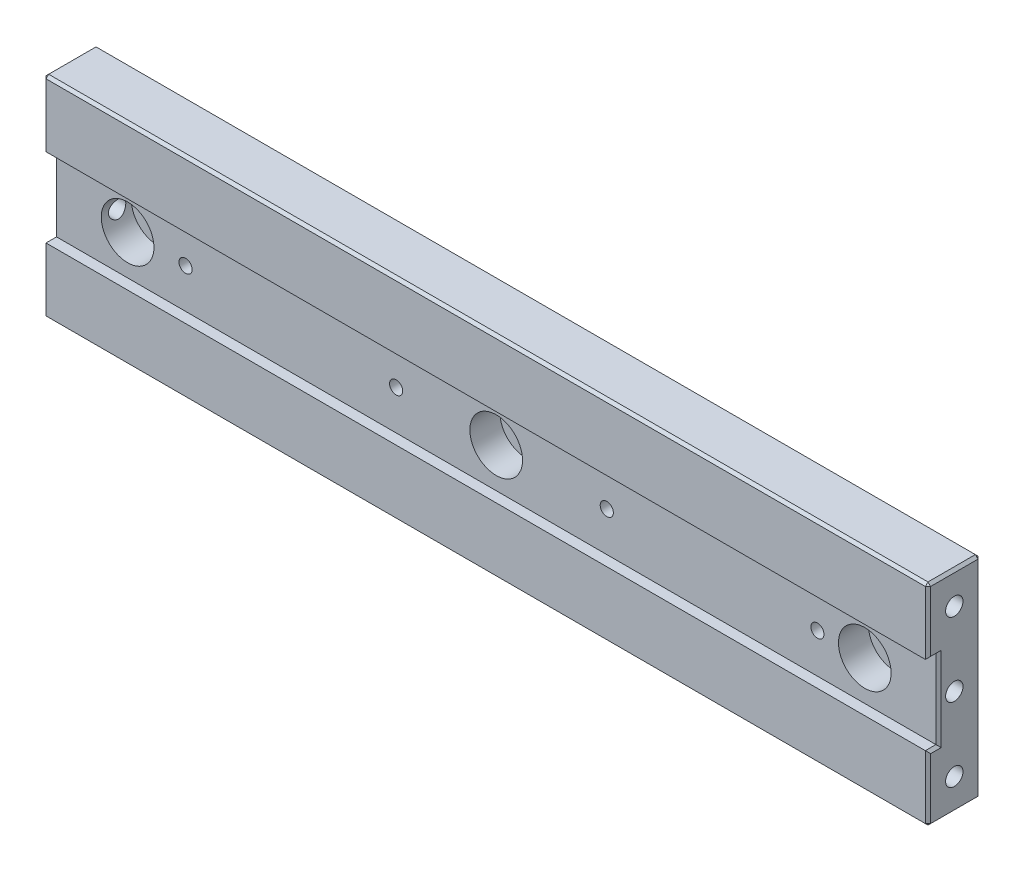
ISO-10303-21;
HEADER;
FILE_DESCRIPTION(('STEP AP214'),'2;1');
FILE_NAME('part.step','',(''),(''),'','','');
FILE_SCHEMA(('AUTOMOTIVE_DESIGN { 1 0 10303 214 1 1 1 1 }'));
ENDSEC;
DATA;
#1=APPLICATION_CONTEXT('core data for automotive mechanical design processes');
#2=APPLICATION_PROTOCOL_DEFINITION('international standard','automotive_design',2000,#1);
#3=PRODUCT_CONTEXT('',#1,'mechanical');
#4=PRODUCT('Part','Part','',(#3));
#5=PRODUCT_RELATED_PRODUCT_CATEGORY('part','',(#4));
#6=PRODUCT_DEFINITION_FORMATION('','',#4);
#7=PRODUCT_DEFINITION_CONTEXT('part definition',#1,'design');
#8=PRODUCT_DEFINITION('design','',#6,#7);
#9=PRODUCT_DEFINITION_SHAPE('','',#8);
#10=(LENGTH_UNIT() NAMED_UNIT(*) SI_UNIT(.MILLI.,.METRE.));
#11=(NAMED_UNIT(*) PLANE_ANGLE_UNIT() SI_UNIT($,.RADIAN.));
#12=(NAMED_UNIT(*) SI_UNIT($,.STERADIAN.) SOLID_ANGLE_UNIT());
#13=UNCERTAINTY_MEASURE_WITH_UNIT(LENGTH_MEASURE(1.E-05),#10,'distance_accuracy_value','');
#14=(GEOMETRIC_REPRESENTATION_CONTEXT(3) GLOBAL_UNCERTAINTY_ASSIGNED_CONTEXT((#13)) GLOBAL_UNIT_ASSIGNED_CONTEXT((#10,
#11,#12)) REPRESENTATION_CONTEXT('',''));
#15=CARTESIAN_POINT('',(0.,0.,0.));
#16=DIRECTION('',(0.,0.,1.));
#17=DIRECTION('',(1.,0.,0.));
#18=AXIS2_PLACEMENT_3D('',#15,#16,#17);
#19=CARTESIAN_POINT('',(0.,0.,10.));
#20=DIRECTION('',(0.,0.,1.));
#21=DIRECTION('',(1.,0.,0.));
#22=AXIS2_PLACEMENT_3D('',#19,#20,#21);
#23=PLANE('',#22);
#24=DIRECTION('',(1.,0.,0.));
#25=VECTOR('',#24,1.);
#26=CARTESIAN_POINT('',(84.,-19.5,10.));
#27=LINE('',#26,#25);
#28=CARTESIAN_POINT('',(-83.5,-19.5,10.));
#29=VERTEX_POINT('',#28);
#30=CARTESIAN_POINT('',(83.5,-19.5,10.));
#31=VERTEX_POINT('',#30);
#32=EDGE_CURVE('E618',#29,#31,#27,.T.);
#33=ORIENTED_EDGE('',*,*,#32,.T.);
#34=DIRECTION('',(0.,1.,0.));
#35=VECTOR('',#34,1.);
#36=CARTESIAN_POINT('',(83.5,-7.50000000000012,10.));
#37=LINE('',#36,#35);
#38=CARTESIAN_POINT('',(83.5,-7.50000000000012,10.));
#39=VERTEX_POINT('',#38);
#40=EDGE_CURVE('E616',#31,#39,#37,.T.);
#41=ORIENTED_EDGE('',*,*,#40,.T.);
#42=DIRECTION('',(1.,0.,0.));
#43=VECTOR('',#42,1.);
#44=CARTESIAN_POINT('',(0.,-7.50000000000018,10.));
#45=LINE('',#44,#43);
#46=CARTESIAN_POINT('',(-83.5,-7.50000000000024,10.));
#47=VERTEX_POINT('',#46);
#48=EDGE_CURVE('E244',#47,#39,#45,.T.);
#49=ORIENTED_EDGE('',*,*,#48,.F.);
#50=DIRECTION('',(0.,-1.,0.));
#51=VECTOR('',#50,1.);
#52=CARTESIAN_POINT('',(-83.5,-20.,10.));
#53=LINE('',#52,#51);
#54=EDGE_CURVE('E620',#47,#29,#53,.T.);
#55=ORIENTED_EDGE('',*,*,#54,.T.);
#56=EDGE_LOOP('',(#33,#41,#49,#55));
#57=FACE_BOUND('',#56,.T.);
#58=ADVANCED_FACE('F16',(#57),#23,.T.);
#59=CARTESIAN_POINT('',(84.,20.,10.));
#60=DIRECTION('',(-1.,0.,0.));
#61=DIRECTION('',(0.,0.,1.));
#62=AXIS2_PLACEMENT_3D('',#59,#60,#61);
#63=PLANE('',#62);
#64=DIRECTION('',(0.,0.,-1.));
#65=VECTOR('',#64,1.);
#66=CARTESIAN_POINT('',(84.,7.99999999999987,10.));
#67=LINE('',#66,#65);
#68=CARTESIAN_POINT('',(84.,7.99999999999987,9.5));
#69=VERTEX_POINT('',#68);
#70=CARTESIAN_POINT('',(84.,7.99999999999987,7.5));
#71=VERTEX_POINT('',#70);
#72=EDGE_CURVE('E647',#69,#71,#67,.T.);
#73=ORIENTED_EDGE('',*,*,#72,.T.);
#74=DIRECTION('',(0.,-1.,0.));
#75=VECTOR('',#74,1.);
#76=CARTESIAN_POINT('',(84.,20.,7.5));
#77=LINE('',#76,#75);
#78=CARTESIAN_POINT('',(84.,-8.0000000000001,7.5));
#79=VERTEX_POINT('',#78);
#80=EDGE_CURVE('E639',#71,#79,#77,.T.);
#81=ORIENTED_EDGE('',*,*,#80,.T.);
#82=DIRECTION('',(0.,0.,1.));
#83=VECTOR('',#82,1.);
#84=CARTESIAN_POINT('',(84.,-8.0000000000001,10.));
#85=LINE('',#84,#83);
#86=CARTESIAN_POINT('',(84.,-8.0000000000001,9.5));
#87=VERTEX_POINT('',#86);
#88=EDGE_CURVE('E641',#79,#87,#85,.T.);
#89=ORIENTED_EDGE('',*,*,#88,.T.);
#90=DIRECTION('',(0.,-1.,0.));
#91=VECTOR('',#90,1.);
#92=CARTESIAN_POINT('',(84.,-20.,9.5));
#93=LINE('',#92,#91);
#94=CARTESIAN_POINT('',(84.,-19.5,9.5));
#95=VERTEX_POINT('',#94);
#96=EDGE_CURVE('E643',#87,#95,#93,.T.);
#97=ORIENTED_EDGE('',*,*,#96,.T.);
#98=DIRECTION('',(0.,0.,-1.));
#99=VECTOR('',#98,1.);
#100=CARTESIAN_POINT('',(84.,-19.5,10.));
#101=LINE('',#100,#99);
#102=CARTESIAN_POINT('',(84.,-19.5,0.5));
#103=VERTEX_POINT('',#102);
#104=EDGE_CURVE('E645',#95,#103,#101,.T.);
#105=ORIENTED_EDGE('',*,*,#104,.T.);
#106=DIRECTION('',(0.,1.,0.));
#107=VECTOR('',#106,1.);
#108=CARTESIAN_POINT('',(84.,20.,0.5));
#109=LINE('',#108,#107);
#110=CARTESIAN_POINT('',(84.,19.5,0.5));
#111=VERTEX_POINT('',#110);
#112=EDGE_CURVE('E652',#103,#111,#109,.T.);
#113=ORIENTED_EDGE('',*,*,#112,.T.);
#114=DIRECTION('',(0.,0.,1.));
#115=VECTOR('',#114,1.);
#116=CARTESIAN_POINT('',(84.,19.5,10.));
#117=LINE('',#116,#115);
#118=CARTESIAN_POINT('',(84.,19.5,9.5));
#119=VERTEX_POINT('',#118);
#120=EDGE_CURVE('E489',#111,#119,#117,.T.);
#121=ORIENTED_EDGE('',*,*,#120,.T.);
#122=DIRECTION('',(0.,-1.,0.));
#123=VECTOR('',#122,1.);
#124=CARTESIAN_POINT('',(84.,7.49999999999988,9.5));
#125=LINE('',#124,#123);
#126=EDGE_CURVE('E650',#119,#69,#125,.T.);
#127=ORIENTED_EDGE('',*,*,#126,.T.);
#128=EDGE_LOOP('',(#73,#81,#89,#97,#105,#113,#121,#127));
#129=FACE_BOUND('',#128,.T.);
#130=CARTESIAN_POINT('',(84.,-14.0000000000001,5.));
#131=DIRECTION('',(1.,0.,0.));
#132=DIRECTION('',(0.,0.,-1.));
#133=AXIS2_PLACEMENT_3D('',#130,#131,#132);
#134=CIRCLE('',#133,1.65);
#135=CARTESIAN_POINT('',(84.,-14.0000000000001,3.35));
#136=VERTEX_POINT('',#135);
#137=EDGE_CURVE('E174',#136,#136,#134,.T.);
#138=ORIENTED_EDGE('',*,*,#137,.F.);
#139=EDGE_LOOP('',(#138));
#140=FACE_BOUND('',#139,.T.);
#141=CARTESIAN_POINT('',(84.,-1.20712505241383E-13,5.));
#142=DIRECTION('',(1.,0.,0.));
#143=DIRECTION('',(0.,0.,-1.));
#144=AXIS2_PLACEMENT_3D('',#141,#142,#143);
#145=CIRCLE('',#144,1.65);
#146=CARTESIAN_POINT('',(84.,-1.20712505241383E-13,3.35));
#147=VERTEX_POINT('',#146);
#148=EDGE_CURVE('E173',#147,#147,#145,.T.);
#149=ORIENTED_EDGE('',*,*,#148,.F.);
#150=EDGE_LOOP('',(#149));
#151=FACE_BOUND('',#150,.T.);
#152=CARTESIAN_POINT('',(84.,13.9999999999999,5.));
#153=DIRECTION('',(1.,0.,0.));
#154=DIRECTION('',(0.,0.,-1.));
#155=AXIS2_PLACEMENT_3D('',#152,#153,#154);
#156=CIRCLE('',#155,1.65);
#157=CARTESIAN_POINT('',(84.,13.9999999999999,3.35));
#158=VERTEX_POINT('',#157);
#159=EDGE_CURVE('E183',#158,#158,#156,.T.);
#160=ORIENTED_EDGE('',*,*,#159,.F.);
#161=EDGE_LOOP('',(#160));
#162=FACE_BOUND('',#161,.T.);
#163=ADVANCED_FACE('F291',(#129,#140,#151,#162),#63,.F.);
#164=CARTESIAN_POINT('',(-84.,20.,10.));
#165=DIRECTION('',(0.,-1.,0.));
#166=DIRECTION('',(0.,0.,-1.));
#167=AXIS2_PLACEMENT_3D('',#164,#165,#166);
#168=PLANE('',#167);
#169=DIRECTION('',(1.,0.,0.));
#170=VECTOR('',#169,1.);
#171=CARTESIAN_POINT('',(84.,20.,9.5));
#172=LINE('',#171,#170);
#173=CARTESIAN_POINT('',(-83.5,20.,9.5));
#174=VERTEX_POINT('',#173);
#175=CARTESIAN_POINT('',(83.5,20.,9.5));
#176=VERTEX_POINT('',#175);
#177=EDGE_CURVE('E25',#174,#176,#172,.T.);
#178=ORIENTED_EDGE('',*,*,#177,.T.);
#179=DIRECTION('',(0.,0.,-1.));
#180=VECTOR('',#179,1.);
#181=CARTESIAN_POINT('',(83.5,20.,10.));
#182=LINE('',#181,#180);
#183=CARTESIAN_POINT('',(83.5,20.,0.5));
#184=VERTEX_POINT('',#183);
#185=EDGE_CURVE('E11',#176,#184,#182,.T.);
#186=ORIENTED_EDGE('',*,*,#185,.T.);
#187=DIRECTION('',(-1.,0.,0.));
#188=VECTOR('',#187,1.);
#189=CARTESIAN_POINT('',(-84.,20.,0.5));
#190=LINE('',#189,#188);
#191=CARTESIAN_POINT('',(-83.5,20.,0.5));
#192=VERTEX_POINT('',#191);
#193=EDGE_CURVE('E403',#184,#192,#190,.T.);
#194=ORIENTED_EDGE('',*,*,#193,.T.);
#195=DIRECTION('',(0.,0.,1.));
#196=VECTOR('',#195,1.);
#197=CARTESIAN_POINT('',(-83.5,20.,10.));
#198=LINE('',#197,#196);
#199=EDGE_CURVE('E36',#192,#174,#198,.T.);
#200=ORIENTED_EDGE('',*,*,#199,.T.);
#201=EDGE_LOOP('',(#178,#186,#194,#200));
#202=FACE_BOUND('',#201,.T.);
#203=ADVANCED_FACE('F299',(#202),#168,.F.);
#204=CARTESIAN_POINT('',(-84.,20.,10.));
#205=DIRECTION('',(1.,0.,0.));
#206=DIRECTION('',(0.,0.,-1.));
#207=AXIS2_PLACEMENT_3D('',#204,#205,#206);
#208=PLANE('',#207);
#209=DIRECTION('',(0.,0.,-1.));
#210=VECTOR('',#209,1.);
#211=CARTESIAN_POINT('',(-84.,19.5,10.));
#212=LINE('',#211,#210);
#213=CARTESIAN_POINT('',(-84.,19.5,9.5));
#214=VERTEX_POINT('',#213);
#215=CARTESIAN_POINT('',(-84.,19.5,0.5));
#216=VERTEX_POINT('',#215);
#217=EDGE_CURVE('E474',#214,#216,#212,.T.);
#218=ORIENTED_EDGE('',*,*,#217,.T.);
#219=DIRECTION('',(0.,-1.,0.));
#220=VECTOR('',#219,1.);
#221=CARTESIAN_POINT('',(-84.,20.,0.5));
#222=LINE('',#221,#220);
#223=CARTESIAN_POINT('',(-84.,-19.5,0.5));
#224=VERTEX_POINT('',#223);
#225=EDGE_CURVE('E600',#216,#224,#222,.T.);
#226=ORIENTED_EDGE('',*,*,#225,.T.);
#227=DIRECTION('',(0.,0.,1.));
#228=VECTOR('',#227,1.);
#229=CARTESIAN_POINT('',(-84.,-19.5,10.));
#230=LINE('',#229,#228);
#231=CARTESIAN_POINT('',(-84.,-19.5,9.5));
#232=VERTEX_POINT('',#231);
#233=EDGE_CURVE('E395',#224,#232,#230,.T.);
#234=ORIENTED_EDGE('',*,*,#233,.T.);
#235=DIRECTION('',(0.,1.,0.));
#236=VECTOR('',#235,1.);
#237=CARTESIAN_POINT('',(-84.,-7.50000000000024,9.5));
#238=LINE('',#237,#236);
#239=CARTESIAN_POINT('',(-84.,-8.00000000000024,9.5));
#240=VERTEX_POINT('',#239);
#241=EDGE_CURVE('E606',#232,#240,#238,.T.);
#242=ORIENTED_EDGE('',*,*,#241,.T.);
#243=DIRECTION('',(0.,0.,-1.));
#244=VECTOR('',#243,1.);
#245=CARTESIAN_POINT('',(-84.,-8.00000000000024,10.));
#246=LINE('',#245,#244);
#247=CARTESIAN_POINT('',(-84.,-8.00000000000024,7.5));
#248=VERTEX_POINT('',#247);
#249=EDGE_CURVE('E608',#240,#248,#246,.T.);
#250=ORIENTED_EDGE('',*,*,#249,.T.);
#251=DIRECTION('',(0.,1.,0.));
#252=VECTOR('',#251,1.);
#253=CARTESIAN_POINT('',(-84.,20.,7.5));
#254=LINE('',#253,#252);
#255=CARTESIAN_POINT('',(-84.,7.99999999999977,7.5));
#256=VERTEX_POINT('',#255);
#257=EDGE_CURVE('E610',#248,#256,#254,.T.);
#258=ORIENTED_EDGE('',*,*,#257,.T.);
#259=DIRECTION('',(0.,0.,1.));
#260=VECTOR('',#259,1.);
#261=CARTESIAN_POINT('',(-84.,7.99999999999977,10.));
#262=LINE('',#261,#260);
#263=CARTESIAN_POINT('',(-84.,7.99999999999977,9.5));
#264=VERTEX_POINT('',#263);
#265=EDGE_CURVE('E612',#256,#264,#262,.T.);
#266=ORIENTED_EDGE('',*,*,#265,.T.);
#267=DIRECTION('',(0.,1.,0.));
#268=VECTOR('',#267,1.);
#269=CARTESIAN_POINT('',(-84.,20.,9.5));
#270=LINE('',#269,#268);
#271=EDGE_CURVE('E346',#264,#214,#270,.T.);
#272=ORIENTED_EDGE('',*,*,#271,.T.);
#273=EDGE_LOOP('',(#218,#226,#234,#242,#250,#258,#266,#272));
#274=FACE_BOUND('',#273,.T.);
#275=CARTESIAN_POINT('',(-84.,14.,5.));
#276=DIRECTION('',(-1.,0.,0.));
#277=DIRECTION('',(0.,0.,1.));
#278=AXIS2_PLACEMENT_3D('',#275,#276,#277);
#279=CIRCLE('',#278,1.65);
#280=CARTESIAN_POINT('',(-84.,14.,6.65));
#281=VERTEX_POINT('',#280);
#282=EDGE_CURVE('E219',#281,#281,#279,.T.);
#283=ORIENTED_EDGE('',*,*,#282,.F.);
#284=EDGE_LOOP('',(#283));
#285=FACE_BOUND('',#284,.T.);
#286=CARTESIAN_POINT('',(-84.,0.,5.));
#287=DIRECTION('',(-1.,0.,0.));
#288=DIRECTION('',(0.,0.,1.));
#289=AXIS2_PLACEMENT_3D('',#286,#287,#288);
#290=CIRCLE('',#289,1.65);
#291=CARTESIAN_POINT('',(-84.,0.,6.65));
#292=VERTEX_POINT('',#291);
#293=EDGE_CURVE('E226',#292,#292,#290,.T.);
#294=ORIENTED_EDGE('',*,*,#293,.F.);
#295=EDGE_LOOP('',(#294));
#296=FACE_BOUND('',#295,.T.);
#297=CARTESIAN_POINT('',(-84.,-14.,5.));
#298=DIRECTION('',(-1.,0.,0.));
#299=DIRECTION('',(0.,0.,1.));
#300=AXIS2_PLACEMENT_3D('',#297,#298,#299);
#301=CIRCLE('',#300,1.65);
#302=CARTESIAN_POINT('',(-84.,-14.,6.65));
#303=VERTEX_POINT('',#302);
#304=EDGE_CURVE('E229',#303,#303,#301,.T.);
#305=ORIENTED_EDGE('',*,*,#304,.F.);
#306=EDGE_LOOP('',(#305));
#307=FACE_BOUND('',#306,.T.);
#308=ADVANCED_FACE('F315',(#274,#285,#296,#307),#208,.F.);
#309=CARTESIAN_POINT('',(-84.,-20.,10.));
#310=DIRECTION('',(0.,1.,0.));
#311=DIRECTION('',(0.,0.,1.));
#312=AXIS2_PLACEMENT_3D('',#309,#310,#311);
#313=PLANE('',#312);
#314=DIRECTION('',(-1.,0.,0.));
#315=VECTOR('',#314,1.);
#316=CARTESIAN_POINT('',(-84.,-20.,9.5));
#317=LINE('',#316,#315);
#318=CARTESIAN_POINT('',(83.5,-20.,9.5));
#319=VERTEX_POINT('',#318);
#320=CARTESIAN_POINT('',(-83.5,-20.,9.5));
#321=VERTEX_POINT('',#320);
#322=EDGE_CURVE('E402',#319,#321,#317,.T.);
#323=ORIENTED_EDGE('',*,*,#322,.T.);
#324=DIRECTION('',(0.,0.,-1.));
#325=VECTOR('',#324,1.);
#326=CARTESIAN_POINT('',(-83.5,-20.,10.));
#327=LINE('',#326,#325);
#328=CARTESIAN_POINT('',(-83.5,-20.,0.5));
#329=VERTEX_POINT('',#328);
#330=EDGE_CURVE('E394',#321,#329,#327,.T.);
#331=ORIENTED_EDGE('',*,*,#330,.T.);
#332=DIRECTION('',(1.,0.,0.));
#333=VECTOR('',#332,1.);
#334=CARTESIAN_POINT('',(-84.,-20.,0.5));
#335=LINE('',#334,#333);
#336=CARTESIAN_POINT('',(83.5,-20.,0.5));
#337=VERTEX_POINT('',#336);
#338=EDGE_CURVE('E399',#329,#337,#335,.T.);
#339=ORIENTED_EDGE('',*,*,#338,.T.);
#340=DIRECTION('',(0.,0.,1.));
#341=VECTOR('',#340,1.);
#342=CARTESIAN_POINT('',(83.5,-20.,10.));
#343=LINE('',#342,#341);
#344=EDGE_CURVE('E406',#337,#319,#343,.T.);
#345=ORIENTED_EDGE('',*,*,#344,.T.);
#346=EDGE_LOOP('',(#323,#331,#339,#345));
#347=FACE_BOUND('',#346,.T.);
#348=ADVANCED_FACE('F306',(#347),#313,.F.);
#349=DIRECTION('',(-1.,0.,0.));
#350=VECTOR('',#349,1.);
#351=CARTESIAN_POINT('',(0.,7.49999999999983,10.));
#352=LINE('',#351,#350);
#353=CARTESIAN_POINT('',(83.5,7.49999999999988,10.));
#354=VERTEX_POINT('',#353);
#355=CARTESIAN_POINT('',(-83.5,7.49999999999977,10.));
#356=VERTEX_POINT('',#355);
#357=EDGE_CURVE('E239',#354,#356,#352,.T.);
#358=ORIENTED_EDGE('',*,*,#357,.F.);
#359=DIRECTION('',(0.,1.,0.));
#360=VECTOR('',#359,1.);
#361=CARTESIAN_POINT('',(83.5,20.,10.));
#362=LINE('',#361,#360);
#363=CARTESIAN_POINT('',(83.5,19.5,10.));
#364=VERTEX_POINT('',#363);
#365=EDGE_CURVE('E320',#354,#364,#362,.T.);
#366=ORIENTED_EDGE('',*,*,#365,.T.);
#367=DIRECTION('',(-1.,0.,0.));
#368=VECTOR('',#367,1.);
#369=CARTESIAN_POINT('',(-84.,19.5,10.));
#370=LINE('',#369,#368);
#371=CARTESIAN_POINT('',(-83.5,19.5,10.));
#372=VERTEX_POINT('',#371);
#373=EDGE_CURVE('E480',#364,#372,#370,.T.);
#374=ORIENTED_EDGE('',*,*,#373,.T.);
#375=DIRECTION('',(0.,-1.,0.));
#376=VECTOR('',#375,1.);
#377=CARTESIAN_POINT('',(-83.5,7.49999999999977,10.));
#378=LINE('',#377,#376);
#379=EDGE_CURVE('E323',#372,#356,#378,.T.);
#380=ORIENTED_EDGE('',*,*,#379,.T.);
#381=EDGE_LOOP('',(#358,#366,#374,#380));
#382=FACE_BOUND('',#381,.T.);
#383=ADVANCED_FACE('F294',(#382),#23,.T.);
#384=CARTESIAN_POINT('',(0.,0.,0.));
#385=DIRECTION('',(0.,0.,1.));
#386=DIRECTION('',(1.,0.,0.));
#387=AXIS2_PLACEMENT_3D('',#384,#385,#386);
#388=PLANE('',#387);
#389=CARTESIAN_POINT('',(-59.,-2.16059808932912E-13,0.));
#390=DIRECTION('',(0.,0.,1.));
#391=DIRECTION('',(1.,0.,0.));
#392=AXIS2_PLACEMENT_3D('',#389,#390,#391);
#393=CIRCLE('',#392,1.25);
#394=CARTESIAN_POINT('',(-57.75,-2.16059808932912E-13,0.));
#395=VERTEX_POINT('',#394);
#396=EDGE_CURVE('E1119',#395,#395,#393,.T.);
#397=ORIENTED_EDGE('',*,*,#396,.T.);
#398=EDGE_LOOP('',(#397));
#399=FACE_BOUND('',#398,.T.);
#400=CARTESIAN_POINT('',(-19.,-1.88304233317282E-13,0.));
#401=DIRECTION('',(0.,0.,1.));
#402=DIRECTION('',(1.,0.,0.));
#403=AXIS2_PLACEMENT_3D('',#400,#401,#402);
#404=CIRCLE('',#403,1.25);
#405=CARTESIAN_POINT('',(-17.75,-1.88304233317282E-13,0.));
#406=VERTEX_POINT('',#405);
#407=EDGE_CURVE('E1129',#406,#406,#404,.T.);
#408=ORIENTED_EDGE('',*,*,#407,.T.);
#409=EDGE_LOOP('',(#408));
#410=FACE_BOUND('',#409,.T.);
#411=CARTESIAN_POINT('',(21.,-1.60548657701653E-13,0.));
#412=DIRECTION('',(0.,0.,1.));
#413=DIRECTION('',(1.,0.,0.));
#414=AXIS2_PLACEMENT_3D('',#411,#412,#413);
#415=CIRCLE('',#414,1.25);
#416=CARTESIAN_POINT('',(22.25,-1.60548657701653E-13,0.));
#417=VERTEX_POINT('',#416);
#418=EDGE_CURVE('E1135',#417,#417,#415,.T.);
#419=ORIENTED_EDGE('',*,*,#418,.T.);
#420=EDGE_LOOP('',(#419));
#421=FACE_BOUND('',#420,.T.);
#422=CARTESIAN_POINT('',(61.,-1.32793082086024E-13,0.));
#423=DIRECTION('',(0.,0.,1.));
#424=DIRECTION('',(1.,0.,0.));
#425=AXIS2_PLACEMENT_3D('',#422,#423,#424);
#426=CIRCLE('',#425,1.25);
#427=CARTESIAN_POINT('',(62.25,-1.32793082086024E-13,0.));
#428=VERTEX_POINT('',#427);
#429=EDGE_CURVE('E415',#428,#428,#426,.T.);
#430=ORIENTED_EDGE('',*,*,#429,.T.);
#431=EDGE_LOOP('',(#430));
#432=FACE_BOUND('',#431,.T.);
#433=DIRECTION('',(0.,-1.,0.));
#434=VECTOR('',#433,1.);
#435=CARTESIAN_POINT('',(83.5,0.,0.));
#436=LINE('',#435,#434);
#437=CARTESIAN_POINT('',(83.5,19.5,0.));
#438=VERTEX_POINT('',#437);
#439=CARTESIAN_POINT('',(83.5,-19.5,0.));
#440=VERTEX_POINT('',#439);
#441=EDGE_CURVE('E631',#438,#440,#436,.T.);
#442=ORIENTED_EDGE('',*,*,#441,.T.);
#443=DIRECTION('',(-1.,0.,0.));
#444=VECTOR('',#443,1.);
#445=CARTESIAN_POINT('',(0.,-19.5,0.));
#446=LINE('',#445,#444);
#447=CARTESIAN_POINT('',(-83.5,-19.5,0.));
#448=VERTEX_POINT('',#447);
#449=EDGE_CURVE('E592',#440,#448,#446,.T.);
#450=ORIENTED_EDGE('',*,*,#449,.T.);
#451=DIRECTION('',(0.,1.,0.));
#452=VECTOR('',#451,1.);
#453=CARTESIAN_POINT('',(-83.5,0.,0.));
#454=LINE('',#453,#452);
#455=CARTESIAN_POINT('',(-83.5,19.5,0.));
#456=VERTEX_POINT('',#455);
#457=EDGE_CURVE('E633',#448,#456,#454,.T.);
#458=ORIENTED_EDGE('',*,*,#457,.T.);
#459=DIRECTION('',(1.,0.,0.));
#460=VECTOR('',#459,1.);
#461=CARTESIAN_POINT('',(0.,19.5,0.));
#462=LINE('',#461,#460);
#463=EDGE_CURVE('E466',#456,#438,#462,.T.);
#464=ORIENTED_EDGE('',*,*,#463,.T.);
#465=EDGE_LOOP('',(#442,#450,#458,#464));
#466=FACE_BOUND('',#465,.T.);
#467=CARTESIAN_POINT('',(70.,0.,0.));
#468=DIRECTION('',(0.,0.,1.));
#469=DIRECTION('',(1.,0.,0.));
#470=AXIS2_PLACEMENT_3D('',#467,#468,#469);
#471=CIRCLE('',#470,2.75);
#472=CARTESIAN_POINT('',(72.75,0.,0.));
#473=VERTEX_POINT('',#472);
#474=EDGE_CURVE('E198',#473,#473,#471,.T.);
#475=ORIENTED_EDGE('',*,*,#474,.T.);
#476=EDGE_LOOP('',(#475));
#477=FACE_BOUND('',#476,.T.);
#478=CARTESIAN_POINT('',(0.,0.,0.));
#479=DIRECTION('',(0.,0.,1.));
#480=DIRECTION('',(1.,0.,0.));
#481=AXIS2_PLACEMENT_3D('',#478,#479,#480);
#482=CIRCLE('',#481,2.75);
#483=CARTESIAN_POINT('',(2.75,0.,0.));
#484=VERTEX_POINT('',#483);
#485=EDGE_CURVE('E208',#484,#484,#482,.T.);
#486=ORIENTED_EDGE('',*,*,#485,.T.);
#487=EDGE_LOOP('',(#486));
#488=FACE_BOUND('',#487,.T.);
#489=CARTESIAN_POINT('',(-70.,0.,0.));
#490=DIRECTION('',(0.,0.,1.));
#491=DIRECTION('',(1.,0.,0.));
#492=AXIS2_PLACEMENT_3D('',#489,#490,#491);
#493=CIRCLE('',#492,2.75);
#494=CARTESIAN_POINT('',(-67.25,0.,0.));
#495=VERTEX_POINT('',#494);
#496=EDGE_CURVE('E223',#495,#495,#493,.T.);
#497=ORIENTED_EDGE('',*,*,#496,.T.);
#498=EDGE_LOOP('',(#497));
#499=FACE_BOUND('',#498,.T.);
#500=ADVANCED_FACE('F305',(#399,#410,#421,#432,#466,#477,#488,#499),#388,.F.);
#501=CARTESIAN_POINT('',(-84.,-7.50000000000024,8.));
#502=DIRECTION('',(0.,0.,-1.));
#503=DIRECTION('',(-1.,0.,0.));
#504=AXIS2_PLACEMENT_3D('',#501,#502,#503);
#505=PLANE('',#504);
#506=CARTESIAN_POINT('',(-59.,-2.16059808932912E-13,8.));
#507=DIRECTION('',(0.,0.,1.));
#508=DIRECTION('',(1.,0.,0.));
#509=AXIS2_PLACEMENT_3D('',#506,#507,#508);
#510=CIRCLE('',#509,1.24999999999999);
#511=CARTESIAN_POINT('',(-57.75,-2.16059808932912E-13,8.));
#512=VERTEX_POINT('',#511);
#513=EDGE_CURVE('E1122',#512,#512,#510,.T.);
#514=ORIENTED_EDGE('',*,*,#513,.F.);
#515=EDGE_LOOP('',(#514));
#516=FACE_BOUND('',#515,.T.);
#517=CARTESIAN_POINT('',(-19.,-1.88304233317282E-13,8.));
#518=DIRECTION('',(0.,0.,1.));
#519=DIRECTION('',(1.,0.,0.));
#520=AXIS2_PLACEMENT_3D('',#517,#518,#519);
#521=CIRCLE('',#520,1.24999999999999);
#522=CARTESIAN_POINT('',(-17.75,-1.88304233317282E-13,8.));
#523=VERTEX_POINT('',#522);
#524=EDGE_CURVE('E1124',#523,#523,#521,.T.);
#525=ORIENTED_EDGE('',*,*,#524,.F.);
#526=EDGE_LOOP('',(#525));
#527=FACE_BOUND('',#526,.T.);
#528=CARTESIAN_POINT('',(21.,-1.60548657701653E-13,8.));
#529=DIRECTION('',(0.,0.,1.));
#530=DIRECTION('',(1.,0.,0.));
#531=AXIS2_PLACEMENT_3D('',#528,#529,#530);
#532=CIRCLE('',#531,1.24999999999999);
#533=CARTESIAN_POINT('',(22.25,-1.60548657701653E-13,8.));
#534=VERTEX_POINT('',#533);
#535=EDGE_CURVE('E1132',#534,#534,#532,.T.);
#536=ORIENTED_EDGE('',*,*,#535,.F.);
#537=EDGE_LOOP('',(#536));
#538=FACE_BOUND('',#537,.T.);
#539=CARTESIAN_POINT('',(61.,-1.32793082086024E-13,8.));
#540=DIRECTION('',(0.,0.,1.));
#541=DIRECTION('',(1.,0.,0.));
#542=AXIS2_PLACEMENT_3D('',#539,#540,#541);
#543=CIRCLE('',#542,1.24999999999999);
#544=CARTESIAN_POINT('',(62.25,-1.32793082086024E-13,8.));
#545=VERTEX_POINT('',#544);
#546=EDGE_CURVE('E1138',#545,#545,#543,.T.);
#547=ORIENTED_EDGE('',*,*,#546,.F.);
#548=EDGE_LOOP('',(#547));
#549=FACE_BOUND('',#548,.T.);
#550=CARTESIAN_POINT('',(70.,0.,8.));
#551=DIRECTION('',(0.,0.,1.));
#552=DIRECTION('',(1.,0.,0.));
#553=AXIS2_PLACEMENT_3D('',#550,#551,#552);
#554=CIRCLE('',#553,5.);
#555=CARTESIAN_POINT('',(75.,0.,8.));
#556=VERTEX_POINT('',#555);
#557=EDGE_CURVE('E189',#556,#556,#554,.T.);
#558=ORIENTED_EDGE('',*,*,#557,.F.);
#559=EDGE_LOOP('',(#558));
#560=FACE_BOUND('',#559,.T.);
#561=CARTESIAN_POINT('',(0.,0.,8.));
#562=DIRECTION('',(0.,0.,1.));
#563=DIRECTION('',(1.,0.,0.));
#564=AXIS2_PLACEMENT_3D('',#561,#562,#563);
#565=CIRCLE('',#564,5.);
#566=CARTESIAN_POINT('',(5.,0.,8.));
#567=VERTEX_POINT('',#566);
#568=EDGE_CURVE('E199',#567,#567,#565,.T.);
#569=ORIENTED_EDGE('',*,*,#568,.F.);
#570=EDGE_LOOP('',(#569));
#571=FACE_BOUND('',#570,.T.);
#572=CARTESIAN_POINT('',(-70.,0.,8.));
#573=DIRECTION('',(0.,0.,1.));
#574=DIRECTION('',(1.,0.,0.));
#575=AXIS2_PLACEMENT_3D('',#572,#573,#574);
#576=CIRCLE('',#575,5.);
#577=CARTESIAN_POINT('',(-65.,0.,8.));
#578=VERTEX_POINT('',#577);
#579=EDGE_CURVE('E209',#578,#578,#576,.T.);
#580=ORIENTED_EDGE('',*,*,#579,.F.);
#581=EDGE_LOOP('',(#580));
#582=FACE_BOUND('',#581,.T.);
#583=DIRECTION('',(1.,0.,0.));
#584=VECTOR('',#583,1.);
#585=CARTESIAN_POINT('',(-84.,-7.50000000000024,8.));
#586=LINE('',#585,#584);
#587=CARTESIAN_POINT('',(-83.5,-7.50000000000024,8.));
#588=VERTEX_POINT('',#587);
#589=CARTESIAN_POINT('',(83.5,-7.50000000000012,8.));
#590=VERTEX_POINT('',#589);
#591=EDGE_CURVE('E236',#588,#590,#586,.T.);
#592=ORIENTED_EDGE('',*,*,#591,.T.);
#593=DIRECTION('',(0.,1.,0.));
#594=VECTOR('',#593,1.);
#595=CARTESIAN_POINT('',(83.5,-7.50000000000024,8.));
#596=LINE('',#595,#594);
#597=CARTESIAN_POINT('',(83.5,7.49999999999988,8.));
#598=VERTEX_POINT('',#597);
#599=EDGE_CURVE('E626',#590,#598,#596,.T.);
#600=ORIENTED_EDGE('',*,*,#599,.T.);
#601=DIRECTION('',(1.,0.,0.));
#602=VECTOR('',#601,1.);
#603=CARTESIAN_POINT('',(-84.,7.49999999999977,8.));
#604=LINE('',#603,#602);
#605=CARTESIAN_POINT('',(-83.5,7.49999999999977,8.));
#606=VERTEX_POINT('',#605);
#607=EDGE_CURVE('E235',#606,#598,#604,.T.);
#608=ORIENTED_EDGE('',*,*,#607,.F.);
#609=DIRECTION('',(0.,-1.,0.));
#610=VECTOR('',#609,1.);
#611=CARTESIAN_POINT('',(-83.5,-7.50000000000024,8.));
#612=LINE('',#611,#610);
#613=EDGE_CURVE('E628',#606,#588,#612,.T.);
#614=ORIENTED_EDGE('',*,*,#613,.T.);
#615=EDGE_LOOP('',(#592,#600,#608,#614));
#616=FACE_BOUND('',#615,.T.);
#617=ADVANCED_FACE('F313',(#516,#527,#538,#549,#560,#571,#582,#616),#505,.F.);
#618=CARTESIAN_POINT('',(-84.,-7.50000000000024,8.));
#619=DIRECTION('',(0.,-1.,0.));
#620=DIRECTION('',(1.,0.,0.));
#621=AXIS2_PLACEMENT_3D('',#618,#619,#620);
#622=PLANE('',#621);
#623=ORIENTED_EDGE('',*,*,#48,.T.);
#624=DIRECTION('',(0.,0.,-1.));
#625=VECTOR('',#624,1.);
#626=CARTESIAN_POINT('',(83.5,-7.50000000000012,8.));
#627=LINE('',#626,#625);
#628=EDGE_CURVE('E622',#39,#590,#627,.T.);
#629=ORIENTED_EDGE('',*,*,#628,.T.);
#630=ORIENTED_EDGE('',*,*,#591,.F.);
#631=DIRECTION('',(0.,0.,1.));
#632=VECTOR('',#631,1.);
#633=CARTESIAN_POINT('',(-83.5,-7.50000000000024,8.));
#634=LINE('',#633,#632);
#635=EDGE_CURVE('E624',#588,#47,#634,.T.);
#636=ORIENTED_EDGE('',*,*,#635,.T.);
#637=EDGE_LOOP('',(#623,#629,#630,#636));
#638=FACE_BOUND('',#637,.T.);
#639=ADVANCED_FACE('F703',(#638),#622,.F.);
#640=CARTESIAN_POINT('',(-84.,7.49999999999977,8.));
#641=DIRECTION('',(0.,1.,0.));
#642=DIRECTION('',(-1.,0.,0.));
#643=AXIS2_PLACEMENT_3D('',#640,#641,#642);
#644=PLANE('',#643);
#645=ORIENTED_EDGE('',*,*,#607,.T.);
#646=DIRECTION('',(0.,0.,1.));
#647=VECTOR('',#646,1.);
#648=CARTESIAN_POINT('',(83.5,7.49999999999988,8.));
#649=LINE('',#648,#647);
#650=EDGE_CURVE('E330',#598,#354,#649,.T.);
#651=ORIENTED_EDGE('',*,*,#650,.T.);
#652=ORIENTED_EDGE('',*,*,#357,.T.);
#653=DIRECTION('',(0.,0.,-1.));
#654=VECTOR('',#653,1.);
#655=CARTESIAN_POINT('',(-83.5,7.49999999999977,8.));
#656=LINE('',#655,#654);
#657=EDGE_CURVE('E247',#356,#606,#656,.T.);
#658=ORIENTED_EDGE('',*,*,#657,.T.);
#659=EDGE_LOOP('',(#645,#651,#652,#658));
#660=FACE_BOUND('',#659,.T.);
#661=ADVANCED_FACE('F327',(#660),#644,.F.);
#662=CARTESIAN_POINT('',(-73.9,-14.,5.));
#663=DIRECTION('',(-1.,0.,0.));
#664=DIRECTION('',(0.,0.,1.));
#665=AXIS2_PLACEMENT_3D('',#662,#663,#664);
#666=CONICAL_SURFACE('',#665,1.65,1.02974425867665);
#667=CARTESIAN_POINT('',(-72.9085799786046,-14.,5.));
#668=VERTEX_POINT('',#667);
#669=VERTEX_LOOP('',#668);
#670=FACE_BOUND('',#669,.T.);
#671=CARTESIAN_POINT('',(-73.9,-14.,5.));
#672=DIRECTION('',(-1.,0.,0.));
#673=DIRECTION('',(0.,0.,1.));
#674=AXIS2_PLACEMENT_3D('',#671,#672,#673);
#675=CIRCLE('',#674,1.65);
#676=CARTESIAN_POINT('',(-73.9,-14.,6.65));
#677=VERTEX_POINT('',#676);
#678=EDGE_CURVE('E232',#677,#677,#675,.T.);
#679=ORIENTED_EDGE('',*,*,#678,.T.);
#680=EDGE_LOOP('',(#679));
#681=FACE_BOUND('',#680,.T.);
#682=ADVANCED_FACE('F746',(#670,#681),#666,.F.);
#683=CARTESIAN_POINT('',(-84.,-14.,5.));
#684=DIRECTION('',(-1.,0.,0.));
#685=DIRECTION('',(0.,0.,1.));
#686=AXIS2_PLACEMENT_3D('',#683,#684,#685);
#687=CYLINDRICAL_SURFACE('',#686,1.65);
#688=ORIENTED_EDGE('',*,*,#678,.F.);
#689=EDGE_LOOP('',(#688));
#690=FACE_BOUND('',#689,.T.);
#691=ORIENTED_EDGE('',*,*,#304,.T.);
#692=EDGE_LOOP('',(#691));
#693=FACE_BOUND('',#692,.T.);
#694=ADVANCED_FACE('F287',(#690,#693),#687,.F.);
#695=CARTESIAN_POINT('',(-84.,0.,5.));
#696=DIRECTION('',(-1.,0.,0.));
#697=DIRECTION('',(0.,0.,1.));
#698=AXIS2_PLACEMENT_3D('',#695,#696,#697);
#699=CYLINDRICAL_SURFACE('',#698,1.65);
#700=CARTESIAN_POINT('',(-75.,0.,6.65));
#701=CARTESIAN_POINT('',(-75.0000001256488,-0.0900803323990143,6.65000024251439));
#702=CARTESIAN_POINT('',(-74.9975431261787,-0.180159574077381,6.64259916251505));
#703=CARTESIAN_POINT('',(-74.9879834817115,-0.357667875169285,6.61327885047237));
#704=CARTESIAN_POINT('',(-74.9808802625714,-0.445096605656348,6.59135782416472));
#705=CARTESIAN_POINT('',(-74.962800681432,-0.614719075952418,6.53382868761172));
#706=CARTESIAN_POINT('',(-74.9518307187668,-0.696921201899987,6.49824318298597));
#707=CARTESIAN_POINT('',(-74.9271394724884,-0.854190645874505,6.41449642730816));
#708=CARTESIAN_POINT('',(-74.9134176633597,-0.929256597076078,6.36633277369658));
#709=CARTESIAN_POINT('',(-74.8841466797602,-1.07267700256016,6.2570751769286));
#710=CARTESIAN_POINT('',(-74.8685543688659,-1.14075502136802,6.19562998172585));
#711=CARTESIAN_POINT('',(-74.8375390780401,-1.26585047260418,6.06230048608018));
#712=CARTESIAN_POINT('',(-74.8221161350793,-1.32286553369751,5.9904139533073));
#713=CARTESIAN_POINT('',(-74.7927131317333,-1.42578155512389,5.83576938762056));
#714=CARTESIAN_POINT('',(-74.7787857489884,-1.47132547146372,5.75276276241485));
#715=CARTESIAN_POINT('',(-74.7546054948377,-1.54768950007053,5.57973436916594));
#716=CARTESIAN_POINT('',(-74.7443515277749,-1.57851400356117,5.48971470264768));
#717=CARTESIAN_POINT('',(-74.729132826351,-1.62353134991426,5.30835517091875));
#718=CARTESIAN_POINT('',(-74.7240041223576,-1.63824134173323,5.21715783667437));
#719=CARTESIAN_POINT('',(-74.7191313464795,-1.65222861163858,5.033456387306));
#720=CARTESIAN_POINT('',(-74.7193856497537,-1.65151054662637,4.94095267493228));
#721=CARTESIAN_POINT('',(-74.7251062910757,-1.63506410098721,4.7616527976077));
#722=CARTESIAN_POINT('',(-74.7303392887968,-1.62000769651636,4.6747862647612));
#723=CARTESIAN_POINT('',(-74.7450463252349,-1.5764070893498,4.50488909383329));
#724=CARTESIAN_POINT('',(-74.7545208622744,-1.54786130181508,4.42185890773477));
#725=CARTESIAN_POINT('',(-74.77681173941,-1.47764674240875,4.26045256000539));
#726=CARTESIAN_POINT('',(-74.7896787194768,-1.43577693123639,4.18217114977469));
#727=CARTESIAN_POINT('',(-74.8172831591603,-1.34024242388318,4.03353163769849));
#728=CARTESIAN_POINT('',(-74.8320211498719,-1.2865743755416,3.96317579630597));
#729=CARTESIAN_POINT('',(-74.8626279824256,-1.16572801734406,3.82860477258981));
#730=CARTESIAN_POINT('',(-74.8785161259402,-1.09799945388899,3.76488712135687));
#731=CARTESIAN_POINT('',(-74.9089733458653,-0.952622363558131,3.64958582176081));
#732=CARTESIAN_POINT('',(-74.9235423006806,-0.874972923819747,3.59800329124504));
#733=CARTESIAN_POINT('',(-74.9499042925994,-0.710918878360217,3.508046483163));
#734=CARTESIAN_POINT('',(-74.9616694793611,-0.624437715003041,3.46980310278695));
#735=CARTESIAN_POINT('',(-74.9808963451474,-0.445788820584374,3.4085602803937));
#736=CARTESIAN_POINT('',(-74.9883594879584,-0.353623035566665,3.3855556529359));
#737=CARTESIAN_POINT('',(-74.9979000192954,-0.170434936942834,3.35631921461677));
#738=CARTESIAN_POINT('',(-75.0001932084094,-0.0795310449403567,3.34941490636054));
#739=CARTESIAN_POINT('',(-74.9997812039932,0.102152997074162,3.35066263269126));
#740=CARTESIAN_POINT('',(-74.9970768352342,0.192933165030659,3.35881218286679));
#741=CARTESIAN_POINT('',(-74.9871159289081,0.369117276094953,3.38940282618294));
#742=CARTESIAN_POINT('',(-74.979990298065,0.454600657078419,3.41143321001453));
#743=CARTESIAN_POINT('',(-74.9620361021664,0.62062539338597,3.46864869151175));
#744=CARTESIAN_POINT('',(-74.9512070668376,0.701166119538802,3.50383545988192));
#745=CARTESIAN_POINT('',(-74.9265973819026,0.857353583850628,3.58738101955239));
#746=CARTESIAN_POINT('',(-74.9127472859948,0.932818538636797,3.6360586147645));
#747=CARTESIAN_POINT('',(-74.8836680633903,1.07472879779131,3.74482823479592));
#748=CARTESIAN_POINT('',(-74.8684385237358,1.14117138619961,3.80492368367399));
#749=CARTESIAN_POINT('',(-74.8374590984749,1.26622547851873,3.93798617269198));
#750=CARTESIAN_POINT('',(-74.8217162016,1.32435715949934,4.01140686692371));
#751=CARTESIAN_POINT('',(-74.7921856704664,1.42753142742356,4.1672998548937));
#752=CARTESIAN_POINT('',(-74.7783980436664,1.47257396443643,4.24977218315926));
#753=CARTESIAN_POINT('',(-74.7544774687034,1.54806908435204,4.42142548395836));
#754=CARTESIAN_POINT('',(-74.7443358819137,1.57855621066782,4.51058998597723));
#755=CARTESIAN_POINT('',(-74.728992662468,1.62395003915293,4.69319790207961));
#756=CARTESIAN_POINT('',(-74.7237888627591,1.63886357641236,4.78663942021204));
#757=CARTESIAN_POINT('',(-74.7191535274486,1.6521604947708,4.97008542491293));
#758=CARTESIAN_POINT('',(-74.7194444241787,1.65133872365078,5.06002593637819));
#759=CARTESIAN_POINT('',(-74.7250813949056,1.63513842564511,5.23841659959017));
#760=CARTESIAN_POINT('',(-74.7304271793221,1.61976073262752,5.32686683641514));
#761=CARTESIAN_POINT('',(-74.7453669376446,1.57544291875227,5.49816413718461));
#762=CARTESIAN_POINT('',(-74.7548816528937,1.54675527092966,5.58108397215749));
#763=CARTESIAN_POINT('',(-74.7770593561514,1.47683540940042,5.74099749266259));
#764=CARTESIAN_POINT('',(-74.7897230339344,1.43560044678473,5.81798987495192));
#765=CARTESIAN_POINT('',(-74.8174493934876,1.33969084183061,5.96744345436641));
#766=CARTESIAN_POINT('',(-74.8325917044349,1.28451538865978,6.03956841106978));
#767=CARTESIAN_POINT('',(-74.8632304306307,1.16314331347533,6.17379258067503));
#768=CARTESIAN_POINT('',(-74.878726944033,1.09694360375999,6.23588897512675));
#769=CARTESIAN_POINT('',(-74.9090331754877,0.95238767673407,6.35066333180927));
#770=CARTESIAN_POINT('',(-74.9237945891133,0.873665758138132,6.40289502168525));
#771=CARTESIAN_POINT('',(-74.950317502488,0.708077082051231,6.49332485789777));
#772=CARTESIAN_POINT('',(-74.9620798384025,0.621212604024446,6.53152691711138));
#773=CARTESIAN_POINT('',(-74.9807695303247,0.44638654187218,6.59101301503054));
#774=CARTESIAN_POINT('',(-74.9879137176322,0.358709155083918,6.61306352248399));
#775=CARTESIAN_POINT('',(-74.9975282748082,0.180687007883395,6.6425549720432));
#776=CARTESIAN_POINT('',(-74.9999998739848,0.0903429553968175,6.64999975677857));
#777=CARTESIAN_POINT('',(-75.,0.,6.65));
#778=B_SPLINE_CURVE_WITH_KNOTS('',3,(#700,#701,#702,#703,#704,#705,#706,#707,#708,#709,#710,
#711,#712,#713,#714,#715,#716,#717,#718,#719,#720,#721,#722,#723,#724,#725,#726,#727,#728,#729,
#730,#731,#732,#733,#734,#735,#736,#737,#738,#739,#740,#741,#742,#743,#744,#745,#746,#747,#748,
#749,#750,#751,#752,#753,#754,#755,#756,#757,#758,#759,#760,#761,#762,#763,#764,#765,#766,#767,
#768,#769,#770,#771,#772,#773,#774,#775,#776,#777),.UNSPECIFIED.,.T.,.F.,(4,2,2,2,2,2,2,2,2,2,2,
2,2,2,2,2,2,2,2,2,2,2,2,2,2,2,2,2,2,2,2,2,2,2,2,2,2,2,4),(0.,0.2699086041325,0.539850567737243,
0.809347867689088,1.07889668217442,1.35671215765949,1.63458711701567,1.92026489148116,
2.20585738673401,2.48198869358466,2.75803665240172,3.02175295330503,3.28550024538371,
3.55343249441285,3.82144096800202,4.10314526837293,4.38487550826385,4.66929734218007,
4.95362234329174,5.22584041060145,5.49801355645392,5.76248915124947,6.02699834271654,
6.29838751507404,6.56985820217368,6.85340472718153,7.13695233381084,7.41982362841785,
7.7025707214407,7.97107468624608,8.23956327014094,8.50315503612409,8.7668045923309,
9.04176838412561,9.31680931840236,9.60227659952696,9.88766420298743,10.1584309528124,
10.4291264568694),.UNSPECIFIED.);
#779=CARTESIAN_POINT('',(-75.,0.,6.65));
#780=VERTEX_POINT('',#779);
#781=EDGE_CURVE('E218',#780,#780,#778,.T.);
#782=ORIENTED_EDGE('',*,*,#781,.T.);
#783=EDGE_LOOP('',(#782));
#784=FACE_BOUND('',#783,.T.);
#785=ORIENTED_EDGE('',*,*,#293,.T.);
#786=EDGE_LOOP('',(#785));
#787=FACE_BOUND('',#786,.T.);
#788=ADVANCED_FACE('F256',(#784,#787),#699,.F.);
#789=CARTESIAN_POINT('',(-73.9,14.,5.));
#790=DIRECTION('',(-1.,0.,0.));
#791=DIRECTION('',(0.,0.,1.));
#792=AXIS2_PLACEMENT_3D('',#789,#790,#791);
#793=CONICAL_SURFACE('',#792,1.65,1.02974425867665);
#794=CARTESIAN_POINT('',(-72.9085799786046,14.,5.));
#795=VERTEX_POINT('',#794);
#796=VERTEX_LOOP('',#795);
#797=FACE_BOUND('',#796,.T.);
#798=CARTESIAN_POINT('',(-73.9,14.,5.));
#799=DIRECTION('',(-1.,0.,0.));
#800=DIRECTION('',(0.,0.,1.));
#801=AXIS2_PLACEMENT_3D('',#798,#799,#800);
#802=CIRCLE('',#801,1.65);
#803=CARTESIAN_POINT('',(-73.9,14.,6.65));
#804=VERTEX_POINT('',#803);
#805=EDGE_CURVE('E222',#804,#804,#802,.T.);
#806=ORIENTED_EDGE('',*,*,#805,.T.);
#807=EDGE_LOOP('',(#806));
#808=FACE_BOUND('',#807,.T.);
#809=ADVANCED_FACE('F278',(#797,#808),#793,.F.);
#810=CARTESIAN_POINT('',(-84.,14.,5.));
#811=DIRECTION('',(-1.,0.,0.));
#812=DIRECTION('',(0.,0.,1.));
#813=AXIS2_PLACEMENT_3D('',#810,#811,#812);
#814=CYLINDRICAL_SURFACE('',#813,1.65);
#815=ORIENTED_EDGE('',*,*,#805,.F.);
#816=EDGE_LOOP('',(#815));
#817=FACE_BOUND('',#816,.T.);
#818=ORIENTED_EDGE('',*,*,#282,.T.);
#819=EDGE_LOOP('',(#818));
#820=FACE_BOUND('',#819,.T.);
#821=ADVANCED_FACE('F275',(#817,#820),#814,.F.);
#822=CARTESIAN_POINT('',(-70.,0.,8.));
#823=DIRECTION('',(0.,0.,1.));
#824=DIRECTION('',(1.,0.,0.));
#825=AXIS2_PLACEMENT_3D('',#822,#823,#824);
#826=CYLINDRICAL_SURFACE('',#825,2.75);
#827=CARTESIAN_POINT('',(-70.,0.,2.29999999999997));
#828=DIRECTION('',(0.,0.,1.));
#829=DIRECTION('',(1.,0.,0.));
#830=AXIS2_PLACEMENT_3D('',#827,#828,#829);
#831=CIRCLE('',#830,2.75);
#832=CARTESIAN_POINT('',(-67.25,0.,2.29999999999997));
#833=VERTEX_POINT('',#832);
#834=EDGE_CURVE('E215',#833,#833,#831,.T.);
#835=ORIENTED_EDGE('',*,*,#834,.T.);
#836=EDGE_LOOP('',(#835));
#837=FACE_BOUND('',#836,.T.);
#838=ORIENTED_EDGE('',*,*,#496,.F.);
#839=EDGE_LOOP('',(#838));
#840=FACE_BOUND('',#839,.T.);
#841=ADVANCED_FACE('F266',(#837,#840),#826,.F.);
#842=CARTESIAN_POINT('',(-70.,0.,8.));
#843=DIRECTION('',(0.,0.,1.));
#844=DIRECTION('',(1.,0.,0.));
#845=AXIS2_PLACEMENT_3D('',#842,#843,#844);
#846=CYLINDRICAL_SURFACE('',#845,5.);
#847=ORIENTED_EDGE('',*,*,#579,.T.);
#848=EDGE_LOOP('',(#847));
#849=FACE_BOUND('',#848,.T.);
#850=CARTESIAN_POINT('',(-70.,0.,2.29999999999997));
#851=DIRECTION('',(0.,0.,1.));
#852=DIRECTION('',(1.,0.,0.));
#853=AXIS2_PLACEMENT_3D('',#850,#851,#852);
#854=CIRCLE('',#853,5.);
#855=CARTESIAN_POINT('',(-65.,0.,2.29999999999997));
#856=VERTEX_POINT('',#855);
#857=EDGE_CURVE('E212',#856,#856,#854,.T.);
#858=ORIENTED_EDGE('',*,*,#857,.F.);
#859=EDGE_LOOP('',(#858));
#860=FACE_BOUND('',#859,.T.);
#861=ORIENTED_EDGE('',*,*,#781,.F.);
#862=EDGE_LOOP('',(#861));
#863=FACE_BOUND('',#862,.T.);
#864=ADVANCED_FACE('F260',(#849,#860,#863),#846,.F.);
#865=CARTESIAN_POINT('',(-67.25,0.,2.29999999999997));
#866=DIRECTION('',(0.,0.,-1.));
#867=DIRECTION('',(-1.,0.,0.));
#868=AXIS2_PLACEMENT_3D('',#865,#866,#867);
#869=PLANE('',#868);
#870=ORIENTED_EDGE('',*,*,#834,.F.);
#871=EDGE_LOOP('',(#870));
#872=FACE_BOUND('',#871,.T.);
#873=ORIENTED_EDGE('',*,*,#857,.T.);
#874=EDGE_LOOP('',(#873));
#875=FACE_BOUND('',#874,.T.);
#876=ADVANCED_FACE('F265',(#872,#875),#869,.F.);
#877=CARTESIAN_POINT('',(0.,0.,8.));
#878=DIRECTION('',(0.,0.,1.));
#879=DIRECTION('',(1.,0.,0.));
#880=AXIS2_PLACEMENT_3D('',#877,#878,#879);
#881=CYLINDRICAL_SURFACE('',#880,2.75);
#882=CARTESIAN_POINT('',(0.,0.,2.29999999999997));
#883=DIRECTION('',(0.,0.,1.));
#884=DIRECTION('',(1.,0.,0.));
#885=AXIS2_PLACEMENT_3D('',#882,#883,#884);
#886=CIRCLE('',#885,2.75);
#887=CARTESIAN_POINT('',(2.75,0.,2.29999999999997));
#888=VERTEX_POINT('',#887);
#889=EDGE_CURVE('E205',#888,#888,#886,.T.);
#890=ORIENTED_EDGE('',*,*,#889,.T.);
#891=EDGE_LOOP('',(#890));
#892=FACE_BOUND('',#891,.T.);
#893=ORIENTED_EDGE('',*,*,#485,.F.);
#894=EDGE_LOOP('',(#893));
#895=FACE_BOUND('',#894,.T.);
#896=ADVANCED_FACE('F268',(#892,#895),#881,.F.);
#897=CARTESIAN_POINT('',(2.75,0.,2.29999999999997));
#898=DIRECTION('',(0.,0.,-1.));
#899=DIRECTION('',(-1.,0.,0.));
#900=AXIS2_PLACEMENT_3D('',#897,#898,#899);
#901=PLANE('',#900);
#902=ORIENTED_EDGE('',*,*,#889,.F.);
#903=EDGE_LOOP('',(#902));
#904=FACE_BOUND('',#903,.T.);
#905=CARTESIAN_POINT('',(0.,0.,2.29999999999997));
#906=DIRECTION('',(0.,0.,1.));
#907=DIRECTION('',(1.,0.,0.));
#908=AXIS2_PLACEMENT_3D('',#905,#906,#907);
#909=CIRCLE('',#908,5.);
#910=CARTESIAN_POINT('',(5.,0.,2.29999999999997));
#911=VERTEX_POINT('',#910);
#912=EDGE_CURVE('E202',#911,#911,#909,.T.);
#913=ORIENTED_EDGE('',*,*,#912,.T.);
#914=EDGE_LOOP('',(#913));
#915=FACE_BOUND('',#914,.T.);
#916=ADVANCED_FACE('F811',(#904,#915),#901,.F.);
#917=CARTESIAN_POINT('',(0.,0.,8.));
#918=DIRECTION('',(0.,0.,1.));
#919=DIRECTION('',(1.,0.,0.));
#920=AXIS2_PLACEMENT_3D('',#917,#918,#919);
#921=CYLINDRICAL_SURFACE('',#920,5.);
#922=ORIENTED_EDGE('',*,*,#912,.F.);
#923=EDGE_LOOP('',(#922));
#924=FACE_BOUND('',#923,.T.);
#925=ORIENTED_EDGE('',*,*,#568,.T.);
#926=EDGE_LOOP('',(#925));
#927=FACE_BOUND('',#926,.T.);
#928=ADVANCED_FACE('F820',(#924,#927),#921,.F.);
#929=CARTESIAN_POINT('',(70.,0.,8.));
#930=DIRECTION('',(0.,0.,1.));
#931=DIRECTION('',(1.,0.,0.));
#932=AXIS2_PLACEMENT_3D('',#929,#930,#931);
#933=CYLINDRICAL_SURFACE('',#932,2.75);
#934=CARTESIAN_POINT('',(70.,0.,2.29999999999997));
#935=DIRECTION('',(0.,0.,1.));
#936=DIRECTION('',(1.,0.,0.));
#937=AXIS2_PLACEMENT_3D('',#934,#935,#936);
#938=CIRCLE('',#937,2.75);
#939=CARTESIAN_POINT('',(72.75,0.,2.29999999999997));
#940=VERTEX_POINT('',#939);
#941=EDGE_CURVE('E195',#940,#940,#938,.T.);
#942=ORIENTED_EDGE('',*,*,#941,.T.);
#943=EDGE_LOOP('',(#942));
#944=FACE_BOUND('',#943,.T.);
#945=ORIENTED_EDGE('',*,*,#474,.F.);
#946=EDGE_LOOP('',(#945));
#947=FACE_BOUND('',#946,.T.);
#948=ADVANCED_FACE('F693',(#944,#947),#933,.F.);
#949=CARTESIAN_POINT('',(72.75,0.,2.29999999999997));
#950=DIRECTION('',(0.,0.,-1.));
#951=DIRECTION('',(-1.,0.,0.));
#952=AXIS2_PLACEMENT_3D('',#949,#950,#951);
#953=PLANE('',#952);
#954=ORIENTED_EDGE('',*,*,#941,.F.);
#955=EDGE_LOOP('',(#954));
#956=FACE_BOUND('',#955,.T.);
#957=CARTESIAN_POINT('',(70.,0.,2.29999999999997));
#958=DIRECTION('',(0.,0.,1.));
#959=DIRECTION('',(1.,0.,0.));
#960=AXIS2_PLACEMENT_3D('',#957,#958,#959);
#961=CIRCLE('',#960,5.);
#962=CARTESIAN_POINT('',(75.,0.,2.29999999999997));
#963=VERTEX_POINT('',#962);
#964=EDGE_CURVE('E192',#963,#963,#961,.T.);
#965=ORIENTED_EDGE('',*,*,#964,.T.);
#966=EDGE_LOOP('',(#965));
#967=FACE_BOUND('',#966,.T.);
#968=ADVANCED_FACE('F682',(#956,#967),#953,.F.);
#969=CARTESIAN_POINT('',(70.,0.,8.));
#970=DIRECTION('',(0.,0.,1.));
#971=DIRECTION('',(1.,0.,0.));
#972=AXIS2_PLACEMENT_3D('',#969,#970,#971);
#973=CYLINDRICAL_SURFACE('',#972,5.);
#974=CARTESIAN_POINT('',(75.,0.,3.35));
#975=CARTESIAN_POINT('',(75.0000001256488,0.0900803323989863,3.34999975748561));
#976=CARTESIAN_POINT('',(74.9975431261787,0.180159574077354,3.35740083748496));
#977=CARTESIAN_POINT('',(74.9879834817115,0.357667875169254,3.38672114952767));
#978=CARTESIAN_POINT('',(74.9808802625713,0.445096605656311,3.40864217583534));
#979=CARTESIAN_POINT('',(74.962800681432,0.614719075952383,3.46617131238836));
#980=CARTESIAN_POINT('',(74.9518307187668,0.696921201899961,3.50175681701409));
#981=CARTESIAN_POINT('',(74.9271394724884,0.854190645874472,3.58550357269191));
#982=CARTESIAN_POINT('',(74.9134176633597,0.929256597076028,3.63366722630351));
#983=CARTESIAN_POINT('',(74.8841466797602,1.07267700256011,3.74292482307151));
#984=CARTESIAN_POINT('',(74.8685543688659,1.14075502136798,3.80437001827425));
#985=CARTESIAN_POINT('',(74.8375390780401,1.26585047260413,3.93769951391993));
#986=CARTESIAN_POINT('',(74.8221161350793,1.32286553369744,4.00958604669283));
#987=CARTESIAN_POINT('',(74.7927131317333,1.42578155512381,4.16423061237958));
#988=CARTESIAN_POINT('',(74.7787857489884,1.47132547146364,4.24723723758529));
#989=CARTESIAN_POINT('',(74.7546054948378,1.54768950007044,4.42026563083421));
#990=CARTESIAN_POINT('',(74.744351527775,1.57851400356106,4.51028529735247));
#991=CARTESIAN_POINT('',(74.7291328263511,1.62353134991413,4.6916448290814));
#992=CARTESIAN_POINT('',(74.7240041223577,1.6382413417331,4.78284216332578));
#993=CARTESIAN_POINT('',(74.7191313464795,1.65222861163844,4.96654361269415));
#994=CARTESIAN_POINT('',(74.7193856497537,1.65151054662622,5.05904732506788));
#995=CARTESIAN_POINT('',(74.7251062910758,1.63506410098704,5.23834720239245));
#996=CARTESIAN_POINT('',(74.7303392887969,1.62000769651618,5.32521373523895));
#997=CARTESIAN_POINT('',(74.7450463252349,1.57640708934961,5.49511090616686));
#998=CARTESIAN_POINT('',(74.7545208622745,1.54786130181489,5.57814109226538));
#999=CARTESIAN_POINT('',(74.7768117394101,1.47764674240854,5.73954743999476));
#1000=CARTESIAN_POINT('',(74.7896787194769,1.43577693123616,5.81782885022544));
#1001=CARTESIAN_POINT('',(74.8172831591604,1.34024242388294,5.96646836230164));
#1002=CARTESIAN_POINT('',(74.832021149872,1.28657437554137,6.03682420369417));
#1003=CARTESIAN_POINT('',(74.8626279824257,1.16572801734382,6.17139522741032));
#1004=CARTESIAN_POINT('',(74.8785161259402,1.09799945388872,6.23511287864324));
#1005=CARTESIAN_POINT('',(74.9089733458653,0.952622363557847,6.35041417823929));
#1006=CARTESIAN_POINT('',(74.9235423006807,0.874972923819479,6.40199670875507));
#1007=CARTESIAN_POINT('',(74.9499042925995,0.710918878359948,6.49195351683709));
#1008=CARTESIAN_POINT('',(74.9616694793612,0.624437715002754,6.5301968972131));
#1009=CARTESIAN_POINT('',(74.9808963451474,0.44578882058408,6.59143971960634));
#1010=CARTESIAN_POINT('',(74.9883594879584,0.35362303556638,6.61444434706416));
#1011=CARTESIAN_POINT('',(74.9979000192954,0.170434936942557,6.64368078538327));
#1012=CARTESIAN_POINT('',(75.0001932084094,0.0795310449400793,6.65058509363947));
#1013=CARTESIAN_POINT('',(74.9997812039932,-0.102152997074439,6.64933736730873));
#1014=CARTESIAN_POINT('',(74.9970768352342,-0.192933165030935,6.64118781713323));
#1015=CARTESIAN_POINT('',(74.9871159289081,-0.369117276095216,6.61059717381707));
#1016=CARTESIAN_POINT('',(74.9799902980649,-0.45460065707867,6.58856678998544));
#1017=CARTESIAN_POINT('',(74.9620361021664,-0.620625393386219,6.5313513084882));
#1018=CARTESIAN_POINT('',(74.9512070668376,-0.701166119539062,6.49616454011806));
#1019=CARTESIAN_POINT('',(74.9265973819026,-0.857353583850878,6.41261898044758));
#1020=CARTESIAN_POINT('',(74.9127472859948,-0.932818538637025,6.36394138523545));
#1021=CARTESIAN_POINT('',(74.8836680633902,-1.07472879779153,6.25517176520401));
#1022=CARTESIAN_POINT('',(74.8684385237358,-1.14117138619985,6.19507631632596));
#1023=CARTESIAN_POINT('',(74.8374590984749,-1.26622547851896,6.06201382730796));
#1024=CARTESIAN_POINT('',(74.8217162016,-1.32435715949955,5.98859313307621));
#1025=CARTESIAN_POINT('',(74.7921856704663,-1.42753142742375,5.83270014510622));
#1026=CARTESIAN_POINT('',(74.7783980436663,-1.47257396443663,5.75022781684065));
#1027=CARTESIAN_POINT('',(74.7544774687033,-1.54806908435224,5.57857451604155));
#1028=CARTESIAN_POINT('',(74.7443358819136,-1.578556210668,5.48941001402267));
#1029=CARTESIAN_POINT('',(74.7289926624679,-1.6239500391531,5.30680209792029));
#1030=CARTESIAN_POINT('',(74.723788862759,-1.63886357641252,5.21336057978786));
#1031=CARTESIAN_POINT('',(74.7191535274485,-1.65216049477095,5.02991457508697));
#1032=CARTESIAN_POINT('',(74.7194444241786,-1.65133872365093,4.93997406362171));
#1033=CARTESIAN_POINT('',(74.7250813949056,-1.63513842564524,4.76158340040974));
#1034=CARTESIAN_POINT('',(74.7304271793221,-1.61976073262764,4.67313316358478));
#1035=CARTESIAN_POINT('',(74.7453669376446,-1.57544291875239,4.50183586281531));
#1036=CARTESIAN_POINT('',(74.7548816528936,-1.54675527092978,4.41891602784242));
#1037=CARTESIAN_POINT('',(74.7770593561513,-1.47683540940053,4.25900250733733));
#1038=CARTESIAN_POINT('',(74.7897230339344,-1.43560044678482,4.18201012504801));
#1039=CARTESIAN_POINT('',(74.8174493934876,-1.3396908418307,4.03255654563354));
#1040=CARTESIAN_POINT('',(74.8325917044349,-1.28451538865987,3.96043158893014));
#1041=CARTESIAN_POINT('',(74.8632304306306,-1.16314331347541,3.8262074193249));
#1042=CARTESIAN_POINT('',(74.878726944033,-1.09694360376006,3.76411102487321));
#1043=CARTESIAN_POINT('',(74.9090331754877,-0.952387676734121,3.6493366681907));
#1044=CARTESIAN_POINT('',(74.9237945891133,-0.873665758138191,3.59710497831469));
#1045=CARTESIAN_POINT('',(74.950317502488,-0.708077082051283,3.50667514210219));
#1046=CARTESIAN_POINT('',(74.9620798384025,-0.621212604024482,3.4684730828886));
#1047=CARTESIAN_POINT('',(74.9807695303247,-0.446386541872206,3.40898698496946));
#1048=CARTESIAN_POINT('',(74.9879137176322,-0.358709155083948,3.386936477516));
#1049=CARTESIAN_POINT('',(74.9975282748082,-0.180687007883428,3.35744502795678));
#1050=CARTESIAN_POINT('',(74.9999998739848,-0.0903429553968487,3.35000024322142));
#1051=CARTESIAN_POINT('',(75.,0.,3.35));
#1052=B_SPLINE_CURVE_WITH_KNOTS('',3,(#974,#975,#976,#977,#978,#979,#980,#981,#982,#983,#984,
#985,#986,#987,#988,#989,#990,#991,#992,#993,#994,#995,#996,#997,#998,#999,#1000,#1001,#1002,
#1003,#1004,#1005,#1006,#1007,#1008,#1009,#1010,#1011,#1012,#1013,#1014,#1015,#1016,#1017,#1018,
#1019,#1020,#1021,#1022,#1023,#1024,#1025,#1026,#1027,#1028,#1029,#1030,#1031,#1032,#1033,#1034,
#1035,#1036,#1037,#1038,#1039,#1040,#1041,#1042,#1043,#1044,#1045,#1046,#1047,#1048,#1049,#1050,
#1051),.UNSPECIFIED.,.T.,.F.,(4,2,2,2,2,2,2,2,2,2,2,2,2,2,2,2,2,2,2,2,2,2,2,2,2,2,2,2,2,2,2,2,2,
2,2,2,2,2,4),(0.,0.269908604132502,0.539850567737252,0.809347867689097,1.07889668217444,
1.35671215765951,1.63458711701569,1.92026489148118,2.20585738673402,2.48198869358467,
2.75803665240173,3.02175295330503,3.28550024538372,3.55343249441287,3.82144096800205,
4.10314526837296,4.38487550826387,4.66929734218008,4.95362234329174,5.22584041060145,
5.4980135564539,5.76248915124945,6.02699834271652,6.29838751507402,6.56985820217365,
6.85340472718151,7.13695233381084,7.41982362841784,7.70257072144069,7.97107468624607,
8.23956327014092,8.50315503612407,8.76680459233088,9.04176838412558,9.31680931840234,
9.60227659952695,9.88766420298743,10.1584309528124,10.4291264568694),.UNSPECIFIED.);
#1053=CARTESIAN_POINT('',(75.,0.,3.35));
#1054=VERTEX_POINT('',#1053);
#1055=EDGE_CURVE('E177',#1054,#1054,#1052,.T.);
#1056=ORIENTED_EDGE('',*,*,#1055,.T.);
#1057=EDGE_LOOP('',(#1056));
#1058=FACE_BOUND('',#1057,.T.);
#1059=ORIENTED_EDGE('',*,*,#964,.F.);
#1060=EDGE_LOOP('',(#1059));
#1061=FACE_BOUND('',#1060,.T.);
#1062=ORIENTED_EDGE('',*,*,#557,.T.);
#1063=EDGE_LOOP('',(#1062));
#1064=FACE_BOUND('',#1063,.T.);
#1065=ADVANCED_FACE('F663',(#1058,#1061,#1064),#973,.F.);
#1066=CARTESIAN_POINT('',(73.9,13.9999999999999,5.));
#1067=DIRECTION('',(1.,0.,0.));
#1068=DIRECTION('',(0.,0.,-1.));
#1069=AXIS2_PLACEMENT_3D('',#1066,#1067,#1068);
#1070=CONICAL_SURFACE('',#1069,1.65,1.02974425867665);
#1071=CARTESIAN_POINT('',(72.9085799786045,13.9999999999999,5.));
#1072=VERTEX_POINT('',#1071);
#1073=VERTEX_LOOP('',#1072);
#1074=FACE_BOUND('',#1073,.T.);
#1075=CARTESIAN_POINT('',(73.9,13.9999999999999,5.));
#1076=DIRECTION('',(1.,0.,0.));
#1077=DIRECTION('',(0.,0.,-1.));
#1078=AXIS2_PLACEMENT_3D('',#1075,#1076,#1077);
#1079=CIRCLE('',#1078,1.65);
#1080=CARTESIAN_POINT('',(73.9,13.9999999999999,3.35));
#1081=VERTEX_POINT('',#1080);
#1082=EDGE_CURVE('E186',#1081,#1081,#1079,.T.);
#1083=ORIENTED_EDGE('',*,*,#1082,.T.);
#1084=EDGE_LOOP('',(#1083));
#1085=FACE_BOUND('',#1084,.T.);
#1086=ADVANCED_FACE('F674',(#1074,#1085),#1070,.F.);
#1087=CARTESIAN_POINT('',(84.,13.9999999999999,5.));
#1088=DIRECTION('',(1.,0.,0.));
#1089=DIRECTION('',(0.,0.,-1.));
#1090=AXIS2_PLACEMENT_3D('',#1087,#1088,#1089);
#1091=CYLINDRICAL_SURFACE('',#1090,1.65);
#1092=ORIENTED_EDGE('',*,*,#1082,.F.);
#1093=EDGE_LOOP('',(#1092));
#1094=FACE_BOUND('',#1093,.T.);
#1095=ORIENTED_EDGE('',*,*,#159,.T.);
#1096=EDGE_LOOP('',(#1095));
#1097=FACE_BOUND('',#1096,.T.);
#1098=ADVANCED_FACE('F670',(#1094,#1097),#1091,.F.);
#1099=CARTESIAN_POINT('',(84.,-1.20712505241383E-13,5.));
#1100=DIRECTION('',(1.,0.,0.));
#1101=DIRECTION('',(0.,0.,-1.));
#1102=AXIS2_PLACEMENT_3D('',#1099,#1100,#1101);
#1103=CYLINDRICAL_SURFACE('',#1102,1.65);
#1104=ORIENTED_EDGE('',*,*,#148,.T.);
#1105=EDGE_LOOP('',(#1104));
#1106=FACE_BOUND('',#1105,.T.);
#1107=ORIENTED_EDGE('',*,*,#1055,.F.);
#1108=EDGE_LOOP('',(#1107));
#1109=FACE_BOUND('',#1108,.T.);
#1110=ADVANCED_FACE('F167',(#1106,#1109),#1103,.F.);
#1111=CARTESIAN_POINT('',(73.9,-14.0000000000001,5.));
#1112=DIRECTION('',(1.,0.,0.));
#1113=DIRECTION('',(0.,0.,-1.));
#1114=AXIS2_PLACEMENT_3D('',#1111,#1112,#1113);
#1115=CONICAL_SURFACE('',#1114,1.65,1.02974425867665);
#1116=CARTESIAN_POINT('',(72.9085799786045,-14.0000000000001,5.));
#1117=VERTEX_POINT('',#1116);
#1118=VERTEX_LOOP('',#1117);
#1119=FACE_BOUND('',#1118,.T.);
#1120=CARTESIAN_POINT('',(73.9,-14.0000000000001,5.));
#1121=DIRECTION('',(1.,0.,0.));
#1122=DIRECTION('',(0.,0.,-1.));
#1123=AXIS2_PLACEMENT_3D('',#1120,#1121,#1122);
#1124=CIRCLE('',#1123,1.65);
#1125=CARTESIAN_POINT('',(73.9,-14.0000000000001,3.35));
#1126=VERTEX_POINT('',#1125);
#1127=EDGE_CURVE('E171',#1126,#1126,#1124,.T.);
#1128=ORIENTED_EDGE('',*,*,#1127,.T.);
#1129=EDGE_LOOP('',(#1128));
#1130=FACE_BOUND('',#1129,.T.);
#1131=ADVANCED_FACE('F163',(#1119,#1130),#1115,.F.);
#1132=CARTESIAN_POINT('',(84.,-14.0000000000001,5.));
#1133=DIRECTION('',(1.,0.,0.));
#1134=DIRECTION('',(0.,0.,-1.));
#1135=AXIS2_PLACEMENT_3D('',#1132,#1133,#1134);
#1136=CYLINDRICAL_SURFACE('',#1135,1.65);
#1137=ORIENTED_EDGE('',*,*,#1127,.F.);
#1138=EDGE_LOOP('',(#1137));
#1139=FACE_BOUND('',#1138,.T.);
#1140=ORIENTED_EDGE('',*,*,#137,.T.);
#1141=EDGE_LOOP('',(#1140));
#1142=FACE_BOUND('',#1141,.T.);
#1143=ADVANCED_FACE('F166',(#1139,#1142),#1136,.F.);
#1144=CARTESIAN_POINT('',(-84.,-8.00000000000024,10.));
#1145=DIRECTION('',(0.707106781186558,-0.707106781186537,0.));
#1146=DIRECTION('',(0.,0.,-1.));
#1147=AXIS2_PLACEMENT_3D('',#1144,#1145,#1146);
#1148=PLANE('',#1147);
#1149=DIRECTION('',(0.577350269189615,0.577350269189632,0.577350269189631));
#1150=VECTOR('',#1149,1.);
#1151=CARTESIAN_POINT('',(-83.1666666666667,-7.16666666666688,8.33333333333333));
#1152=LINE('',#1151,#1150);
#1153=EDGE_CURVE('E379',#248,#588,#1152,.T.);
#1154=ORIENTED_EDGE('',*,*,#1153,.F.);
#1155=ORIENTED_EDGE('',*,*,#249,.F.);
#1156=DIRECTION('',(-0.577350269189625,-0.577350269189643,-0.577350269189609));
#1157=VECTOR('',#1156,1.);
#1158=CARTESIAN_POINT('',(-83.8333333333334,-7.83333333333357,9.66666666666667));
#1159=LINE('',#1158,#1157);
#1160=EDGE_CURVE('E381',#47,#240,#1159,.T.);
#1161=ORIENTED_EDGE('',*,*,#1160,.F.);
#1162=ORIENTED_EDGE('',*,*,#635,.F.);
#1163=EDGE_LOOP('',(#1154,#1155,#1161,#1162));
#1164=FACE_BOUND('',#1163,.T.);
#1165=ADVANCED_FACE('F18',(#1164),#1148,.F.);
#1166=CARTESIAN_POINT('',(-84.,-19.5,0.5));
#1167=DIRECTION('',(-0.577350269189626,-0.577350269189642,-0.57735026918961));
#1168=DIRECTION('',(0.707106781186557,-0.707106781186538,0.));
#1169=AXIS2_PLACEMENT_3D('',#1166,#1167,#1168);
#1170=PLANE('',#1169);
#1171=DIRECTION('',(0.,0.707106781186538,-0.707106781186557));
#1172=VECTOR('',#1171,1.);
#1173=CARTESIAN_POINT('',(-83.5,-19.75,0.25));
#1174=LINE('',#1173,#1172);
#1175=EDGE_CURVE('E373',#329,#448,#1174,.T.);
#1176=ORIENTED_EDGE('',*,*,#1175,.F.);
#1177=DIRECTION('',(0.707106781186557,-0.707106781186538,0.));
#1178=VECTOR('',#1177,1.);
#1179=CARTESIAN_POINT('',(-84.,-19.5,0.5));
#1180=LINE('',#1179,#1178);
#1181=EDGE_CURVE('E20',#224,#329,#1180,.T.);
#1182=ORIENTED_EDGE('',*,*,#1181,.F.);
#1183=DIRECTION('',(-0.707106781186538,0.,0.707106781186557));
#1184=VECTOR('',#1183,1.);
#1185=CARTESIAN_POINT('',(-84.,-19.5,0.5));
#1186=LINE('',#1185,#1184);
#1187=EDGE_CURVE('E376',#448,#224,#1186,.T.);
#1188=ORIENTED_EDGE('',*,*,#1187,.F.);
#1189=EDGE_LOOP('',(#1176,#1182,#1188));
#1190=FACE_BOUND('',#1189,.T.);
#1191=ADVANCED_FACE('F583',(#1190),#1170,.T.);
#1192=CARTESIAN_POINT('',(-83.5,-20.,10.));
#1193=DIRECTION('',(0.707106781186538,0.707106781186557,0.));
#1194=DIRECTION('',(0.,0.,-1.));
#1195=AXIS2_PLACEMENT_3D('',#1192,#1193,#1194);
#1196=PLANE('',#1195);
#1197=ORIENTED_EDGE('',*,*,#1181,.T.);
#1198=ORIENTED_EDGE('',*,*,#330,.F.);
#1199=DIRECTION('',(-0.707106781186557,0.707106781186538,0.));
#1200=VECTOR('',#1199,1.);
#1201=CARTESIAN_POINT('',(-84.,-19.5,9.5));
#1202=LINE('',#1201,#1200);
#1203=EDGE_CURVE('E370',#232,#321,#1202,.F.);
#1204=ORIENTED_EDGE('',*,*,#1203,.F.);
#1205=ORIENTED_EDGE('',*,*,#233,.F.);
#1206=EDGE_LOOP('',(#1197,#1198,#1204,#1205));
#1207=FACE_BOUND('',#1206,.T.);
#1208=ADVANCED_FACE('F392',(#1207),#1196,.F.);
#1209=CARTESIAN_POINT('',(-83.5,0.,10.));
#1210=DIRECTION('',(-0.707106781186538,0.,0.707106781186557));
#1211=DIRECTION('',(0.,1.,0.));
#1212=AXIS2_PLACEMENT_3D('',#1209,#1210,#1211);
#1213=PLANE('',#1212);
#1214=ORIENTED_EDGE('',*,*,#1160,.T.);
#1215=ORIENTED_EDGE('',*,*,#241,.F.);
#1216=DIRECTION('',(-0.707106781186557,0.,-0.707106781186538));
#1217=VECTOR('',#1216,1.);
#1218=CARTESIAN_POINT('',(-84.,-19.5,9.5));
#1219=LINE('',#1218,#1217);
#1220=EDGE_CURVE('E367',#29,#232,#1219,.T.);
#1221=ORIENTED_EDGE('',*,*,#1220,.F.);
#1222=ORIENTED_EDGE('',*,*,#54,.F.);
#1223=EDGE_LOOP('',(#1214,#1215,#1221,#1222));
#1224=FACE_BOUND('',#1223,.T.);
#1225=ADVANCED_FACE('F578',(#1224),#1213,.T.);
#1226=CARTESIAN_POINT('',(-84.,20.,7.5));
#1227=DIRECTION('',(0.707106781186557,0.,-0.707106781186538));
#1228=DIRECTION('',(0.,1.,0.));
#1229=AXIS2_PLACEMENT_3D('',#1226,#1227,#1228);
#1230=PLANE('',#1229);
#1231=ORIENTED_EDGE('',*,*,#1153,.T.);
#1232=ORIENTED_EDGE('',*,*,#613,.F.);
#1233=DIRECTION('',(0.577350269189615,-0.577350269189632,0.577350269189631));
#1234=VECTOR('',#1233,1.);
#1235=CARTESIAN_POINT('',(-88.,12.,3.49999999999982));
#1236=LINE('',#1235,#1234);
#1237=EDGE_CURVE('E340',#256,#606,#1236,.T.);
#1238=ORIENTED_EDGE('',*,*,#1237,.F.);
#1239=ORIENTED_EDGE('',*,*,#257,.F.);
#1240=EDGE_LOOP('',(#1231,#1232,#1238,#1239));
#1241=FACE_BOUND('',#1240,.T.);
#1242=ADVANCED_FACE('F574',(#1241),#1230,.F.);
#1243=CARTESIAN_POINT('',(-84.,20.,0.5));
#1244=DIRECTION('',(0.707106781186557,0.,0.707106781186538));
#1245=DIRECTION('',(0.,-1.,0.));
#1246=AXIS2_PLACEMENT_3D('',#1243,#1244,#1245);
#1247=PLANE('',#1246);
#1248=ORIENTED_EDGE('',*,*,#1187,.T.);
#1249=ORIENTED_EDGE('',*,*,#225,.F.);
#1250=DIRECTION('',(0.707106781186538,0.,-0.707106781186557));
#1251=VECTOR('',#1250,1.);
#1252=CARTESIAN_POINT('',(-83.5,19.5,0.));
#1253=LINE('',#1252,#1251);
#1254=EDGE_CURVE('E363',#456,#216,#1253,.F.);
#1255=ORIENTED_EDGE('',*,*,#1254,.F.);
#1256=ORIENTED_EDGE('',*,*,#457,.F.);
#1257=EDGE_LOOP('',(#1248,#1249,#1255,#1256));
#1258=FACE_BOUND('',#1257,.T.);
#1259=ADVANCED_FACE('F570',(#1258),#1247,.F.);
#1260=CARTESIAN_POINT('',(-84.,-20.,0.5));
#1261=DIRECTION('',(0.,0.707106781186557,0.707106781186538));
#1262=DIRECTION('',(1.,0.,0.));
#1263=AXIS2_PLACEMENT_3D('',#1260,#1261,#1262);
#1264=PLANE('',#1263);
#1265=ORIENTED_EDGE('',*,*,#1175,.T.);
#1266=ORIENTED_EDGE('',*,*,#449,.F.);
#1267=DIRECTION('',(0.,-0.707106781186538,0.707106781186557));
#1268=VECTOR('',#1267,1.);
#1269=CARTESIAN_POINT('',(83.5,-19.5,0.));
#1270=LINE('',#1269,#1268);
#1271=EDGE_CURVE('E360',#337,#440,#1270,.F.);
#1272=ORIENTED_EDGE('',*,*,#1271,.F.);
#1273=ORIENTED_EDGE('',*,*,#338,.F.);
#1274=EDGE_LOOP('',(#1265,#1266,#1272,#1273));
#1275=FACE_BOUND('',#1274,.T.);
#1276=ADVANCED_FACE('F566',(#1275),#1264,.F.);
#1277=CARTESIAN_POINT('',(-84.,-19.5,9.5));
#1278=DIRECTION('',(-0.57735026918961,-0.577350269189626,0.577350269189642));
#1279=DIRECTION('',(0.,-0.707106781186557,-0.707106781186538));
#1280=AXIS2_PLACEMENT_3D('',#1277,#1278,#1279);
#1281=PLANE('',#1280);
#1282=ORIENTED_EDGE('',*,*,#1220,.T.);
#1283=ORIENTED_EDGE('',*,*,#1203,.T.);
#1284=DIRECTION('',(0.,0.707106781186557,0.707106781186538));
#1285=VECTOR('',#1284,1.);
#1286=CARTESIAN_POINT('',(-83.5,-19.75,9.75));
#1287=LINE('',#1286,#1285);
#1288=EDGE_CURVE('E347',#29,#321,#1287,.F.);
#1289=ORIENTED_EDGE('',*,*,#1288,.F.);
#1290=EDGE_LOOP('',(#1282,#1283,#1289));
#1291=FACE_BOUND('',#1290,.T.);
#1292=ADVANCED_FACE('F563',(#1291),#1281,.T.);
#1293=CARTESIAN_POINT('',(-84.,7.99999999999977,10.));
#1294=DIRECTION('',(0.707106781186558,0.707106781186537,0.));
#1295=DIRECTION('',(0.,0.,1.));
#1296=AXIS2_PLACEMENT_3D('',#1293,#1294,#1295);
#1297=PLANE('',#1296);
#1298=ORIENTED_EDGE('',*,*,#1237,.T.);
#1299=ORIENTED_EDGE('',*,*,#657,.F.);
#1300=DIRECTION('',(-0.577350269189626,0.577350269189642,-0.57735026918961));
#1301=VECTOR('',#1300,1.);
#1302=CARTESIAN_POINT('',(-81.,4.99999999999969,12.5));
#1303=LINE('',#1302,#1301);
#1304=EDGE_CURVE('E337',#264,#356,#1303,.F.);
#1305=ORIENTED_EDGE('',*,*,#1304,.F.);
#1306=ORIENTED_EDGE('',*,*,#265,.F.);
#1307=EDGE_LOOP('',(#1298,#1299,#1305,#1306));
#1308=FACE_BOUND('',#1307,.T.);
#1309=ADVANCED_FACE('F335',(#1308),#1297,.F.);
#1310=CARTESIAN_POINT('',(-83.5,19.5,0.));
#1311=DIRECTION('',(-0.577350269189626,0.577350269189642,-0.57735026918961));
#1312=DIRECTION('',(-0.707106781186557,-0.707106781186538,0.));
#1313=AXIS2_PLACEMENT_3D('',#1310,#1311,#1312);
#1314=PLANE('',#1313);
#1315=DIRECTION('',(0.,0.707106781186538,0.707106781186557));
#1316=VECTOR('',#1315,1.);
#1317=CARTESIAN_POINT('',(-83.5,19.5,0.));
#1318=LINE('',#1317,#1316);
#1319=EDGE_CURVE('E354',#456,#192,#1318,.T.);
#1320=ORIENTED_EDGE('',*,*,#1319,.F.);
#1321=ORIENTED_EDGE('',*,*,#1254,.T.);
#1322=DIRECTION('',(-0.707106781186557,-0.707106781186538,0.));
#1323=VECTOR('',#1322,1.);
#1324=CARTESIAN_POINT('',(-83.75,19.75,0.5));
#1325=LINE('',#1324,#1323);
#1326=EDGE_CURVE('E348',#192,#216,#1325,.T.);
#1327=ORIENTED_EDGE('',*,*,#1326,.F.);
#1328=EDGE_LOOP('',(#1320,#1321,#1327));
#1329=FACE_BOUND('',#1328,.T.);
#1330=ADVANCED_FACE('F468',(#1329),#1314,.T.);
#1331=CARTESIAN_POINT('',(83.5,-19.5,0.));
#1332=DIRECTION('',(0.577350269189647,-0.577350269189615,-0.577350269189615));
#1333=DIRECTION('',(0.707106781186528,0.707106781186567,0.));
#1334=AXIS2_PLACEMENT_3D('',#1331,#1332,#1333);
#1335=PLANE('',#1334);
#1336=DIRECTION('',(-0.707106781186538,0.,-0.707106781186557));
#1337=VECTOR('',#1336,1.);
#1338=CARTESIAN_POINT('',(83.5,-19.5,0.));
#1339=LINE('',#1338,#1337);
#1340=EDGE_CURVE('E457',#103,#440,#1339,.T.);
#1341=ORIENTED_EDGE('',*,*,#1340,.F.);
#1342=DIRECTION('',(0.707106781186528,0.707106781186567,0.));
#1343=VECTOR('',#1342,1.);
#1344=CARTESIAN_POINT('',(83.75,-19.75,0.5));
#1345=LINE('',#1344,#1343);
#1346=EDGE_CURVE('E351',#337,#103,#1345,.T.);
#1347=ORIENTED_EDGE('',*,*,#1346,.F.);
#1348=ORIENTED_EDGE('',*,*,#1271,.T.);
#1349=EDGE_LOOP('',(#1341,#1347,#1348));
#1350=FACE_BOUND('',#1349,.T.);
#1351=ADVANCED_FACE('F554',(#1350),#1335,.T.);
#1352=CARTESIAN_POINT('',(84.,-19.5,10.));
#1353=DIRECTION('',(-0.707106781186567,0.707106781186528,0.));
#1354=DIRECTION('',(0.,0.,-1.));
#1355=AXIS2_PLACEMENT_3D('',#1352,#1353,#1354);
#1356=PLANE('',#1355);
#1357=ORIENTED_EDGE('',*,*,#1346,.T.);
#1358=ORIENTED_EDGE('',*,*,#104,.F.);
#1359=DIRECTION('',(-0.707106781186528,-0.707106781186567,0.));
#1360=VECTOR('',#1359,1.);
#1361=CARTESIAN_POINT('',(84.,-19.5,9.5));
#1362=LINE('',#1361,#1360);
#1363=EDGE_CURVE('E454',#319,#95,#1362,.F.);
#1364=ORIENTED_EDGE('',*,*,#1363,.F.);
#1365=ORIENTED_EDGE('',*,*,#344,.F.);
#1366=EDGE_LOOP('',(#1357,#1358,#1364,#1365));
#1367=FACE_BOUND('',#1366,.T.);
#1368=ADVANCED_FACE('F550',(#1367),#1356,.F.);
#1369=CARTESIAN_POINT('',(0.,-19.5,10.));
#1370=DIRECTION('',(0.,-0.707106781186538,0.707106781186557));
#1371=DIRECTION('',(-1.,0.,0.));
#1372=AXIS2_PLACEMENT_3D('',#1369,#1370,#1371);
#1373=PLANE('',#1372);
#1374=ORIENTED_EDGE('',*,*,#1288,.T.);
#1375=ORIENTED_EDGE('',*,*,#322,.F.);
#1376=DIRECTION('',(0.,-0.707106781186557,-0.707106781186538));
#1377=VECTOR('',#1376,1.);
#1378=CARTESIAN_POINT('',(83.5,-19.75,9.75));
#1379=LINE('',#1378,#1377);
#1380=EDGE_CURVE('E451',#31,#319,#1379,.T.);
#1381=ORIENTED_EDGE('',*,*,#1380,.F.);
#1382=ORIENTED_EDGE('',*,*,#32,.F.);
#1383=EDGE_LOOP('',(#1374,#1375,#1381,#1382));
#1384=FACE_BOUND('',#1383,.T.);
#1385=ADVANCED_FACE('F547',(#1384),#1373,.T.);
#1386=CARTESIAN_POINT('',(-83.5,0.,10.));
#1387=DIRECTION('',(-0.707106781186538,0.,0.707106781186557));
#1388=DIRECTION('',(0.,1.,0.));
#1389=AXIS2_PLACEMENT_3D('',#1386,#1387,#1388);
#1390=PLANE('',#1389);
#1391=ORIENTED_EDGE('',*,*,#1304,.T.);
#1392=ORIENTED_EDGE('',*,*,#379,.F.);
#1393=DIRECTION('',(0.707106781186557,0.,0.707106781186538));
#1394=VECTOR('',#1393,1.);
#1395=CARTESIAN_POINT('',(-84.,19.5,9.5));
#1396=LINE('',#1395,#1394);
#1397=EDGE_CURVE('E449',#214,#372,#1396,.T.);
#1398=ORIENTED_EDGE('',*,*,#1397,.F.);
#1399=ORIENTED_EDGE('',*,*,#271,.F.);
#1400=EDGE_LOOP('',(#1391,#1392,#1398,#1399));
#1401=FACE_BOUND('',#1400,.T.);
#1402=ADVANCED_FACE('F343',(#1401),#1390,.T.);
#1403=CARTESIAN_POINT('',(-84.,19.5,10.));
#1404=DIRECTION('',(0.707106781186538,-0.707106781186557,0.));
#1405=DIRECTION('',(0.,0.,-1.));
#1406=AXIS2_PLACEMENT_3D('',#1403,#1404,#1405);
#1407=PLANE('',#1406);
#1408=ORIENTED_EDGE('',*,*,#1326,.T.);
#1409=ORIENTED_EDGE('',*,*,#217,.F.);
#1410=DIRECTION('',(0.707106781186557,0.707106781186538,0.));
#1411=VECTOR('',#1410,1.);
#1412=CARTESIAN_POINT('',(-84.,19.5,9.5));
#1413=LINE('',#1412,#1411);
#1414=EDGE_CURVE('E446',#174,#214,#1413,.F.);
#1415=ORIENTED_EDGE('',*,*,#1414,.F.);
#1416=ORIENTED_EDGE('',*,*,#199,.F.);
#1417=EDGE_LOOP('',(#1408,#1409,#1415,#1416));
#1418=FACE_BOUND('',#1417,.T.);
#1419=ADVANCED_FACE('F472',(#1418),#1407,.F.);
#1420=CARTESIAN_POINT('',(-84.,20.,0.5));
#1421=DIRECTION('',(0.,-0.707106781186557,0.707106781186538));
#1422=DIRECTION('',(-1.,0.,0.));
#1423=AXIS2_PLACEMENT_3D('',#1420,#1421,#1422);
#1424=PLANE('',#1423);
#1425=ORIENTED_EDGE('',*,*,#1319,.T.);
#1426=ORIENTED_EDGE('',*,*,#193,.F.);
#1427=DIRECTION('',(0.,-0.707106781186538,-0.707106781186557));
#1428=VECTOR('',#1427,1.);
#1429=CARTESIAN_POINT('',(83.5,19.75,0.25));
#1430=LINE('',#1429,#1428);
#1431=EDGE_CURVE('E443',#438,#184,#1430,.F.);
#1432=ORIENTED_EDGE('',*,*,#1431,.F.);
#1433=ORIENTED_EDGE('',*,*,#463,.F.);
#1434=EDGE_LOOP('',(#1425,#1426,#1432,#1433));
#1435=FACE_BOUND('',#1434,.T.);
#1436=ADVANCED_FACE('F464',(#1435),#1424,.F.);
#1437=CARTESIAN_POINT('',(84.,20.,0.5));
#1438=DIRECTION('',(-0.707106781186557,0.,0.707106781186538));
#1439=DIRECTION('',(0.,1.,0.));
#1440=AXIS2_PLACEMENT_3D('',#1437,#1438,#1439);
#1441=PLANE('',#1440);
#1442=ORIENTED_EDGE('',*,*,#1340,.T.);
#1443=ORIENTED_EDGE('',*,*,#441,.F.);
#1444=DIRECTION('',(0.707106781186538,0.,0.707106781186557));
#1445=VECTOR('',#1444,1.);
#1446=CARTESIAN_POINT('',(84.,19.5,0.5));
#1447=LINE('',#1446,#1445);
#1448=EDGE_CURVE('E440',#111,#438,#1447,.F.);
#1449=ORIENTED_EDGE('',*,*,#1448,.F.);
#1450=ORIENTED_EDGE('',*,*,#112,.F.);
#1451=EDGE_LOOP('',(#1442,#1443,#1449,#1450));
#1452=FACE_BOUND('',#1451,.T.);
#1453=ADVANCED_FACE('F536',(#1452),#1441,.F.);
#1454=CARTESIAN_POINT('',(84.,-19.5,9.5));
#1455=DIRECTION('',(0.577350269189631,-0.577350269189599,0.577350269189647));
#1456=DIRECTION('',(0.707106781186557,0.,-0.707106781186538));
#1457=AXIS2_PLACEMENT_3D('',#1454,#1455,#1456);
#1458=PLANE('',#1457);
#1459=ORIENTED_EDGE('',*,*,#1380,.T.);
#1460=ORIENTED_EDGE('',*,*,#1363,.T.);
#1461=DIRECTION('',(-0.707106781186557,0.,0.707106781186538));
#1462=VECTOR('',#1461,1.);
#1463=CARTESIAN_POINT('',(84.,-19.5,9.5));
#1464=LINE('',#1463,#1462);
#1465=EDGE_CURVE('E437',#31,#95,#1464,.F.);
#1466=ORIENTED_EDGE('',*,*,#1465,.F.);
#1467=EDGE_LOOP('',(#1459,#1460,#1466));
#1468=FACE_BOUND('',#1467,.T.);
#1469=ADVANCED_FACE('F533',(#1468),#1458,.T.);
#1470=CARTESIAN_POINT('',(-84.,19.5,9.5));
#1471=DIRECTION('',(-0.57735026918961,0.577350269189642,0.577350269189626));
#1472=DIRECTION('',(0.,-0.707106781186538,0.707106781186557));
#1473=AXIS2_PLACEMENT_3D('',#1470,#1471,#1472);
#1474=PLANE('',#1473);
#1475=ORIENTED_EDGE('',*,*,#1414,.T.);
#1476=ORIENTED_EDGE('',*,*,#1397,.T.);
#1477=DIRECTION('',(0.,0.707106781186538,-0.707106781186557));
#1478=VECTOR('',#1477,1.);
#1479=CARTESIAN_POINT('',(-83.5,19.75,9.75));
#1480=LINE('',#1479,#1478);
#1481=EDGE_CURVE('E434',#174,#372,#1480,.F.);
#1482=ORIENTED_EDGE('',*,*,#1481,.F.);
#1483=EDGE_LOOP('',(#1475,#1476,#1482));
#1484=FACE_BOUND('',#1483,.T.);
#1485=ADVANCED_FACE('F476',(#1484),#1474,.T.);
#1486=CARTESIAN_POINT('',(84.,19.5,0.5));
#1487=DIRECTION('',(0.577350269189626,0.577350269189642,-0.57735026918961));
#1488=DIRECTION('',(-0.707106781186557,0.707106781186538,0.));
#1489=AXIS2_PLACEMENT_3D('',#1486,#1487,#1488);
#1490=PLANE('',#1489);
#1491=ORIENTED_EDGE('',*,*,#1448,.T.);
#1492=ORIENTED_EDGE('',*,*,#1431,.T.);
#1493=DIRECTION('',(-0.707106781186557,0.707106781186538,0.));
#1494=VECTOR('',#1493,1.);
#1495=CARTESIAN_POINT('',(84.,19.5,0.5));
#1496=LINE('',#1495,#1494);
#1497=EDGE_CURVE('E432',#111,#184,#1496,.T.);
#1498=ORIENTED_EDGE('',*,*,#1497,.F.);
#1499=EDGE_LOOP('',(#1491,#1492,#1498));
#1500=FACE_BOUND('',#1499,.T.);
#1501=ADVANCED_FACE('F526',(#1500),#1490,.T.);
#1502=CARTESIAN_POINT('',(83.5,0.,10.));
#1503=DIRECTION('',(0.707106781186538,0.,0.707106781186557));
#1504=DIRECTION('',(0.,-1.,0.));
#1505=AXIS2_PLACEMENT_3D('',#1502,#1503,#1504);
#1506=PLANE('',#1505);
#1507=ORIENTED_EDGE('',*,*,#1465,.T.);
#1508=ORIENTED_EDGE('',*,*,#96,.F.);
#1509=DIRECTION('',(0.577350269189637,-0.57735026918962,-0.577350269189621));
#1510=VECTOR('',#1509,1.);
#1511=CARTESIAN_POINT('',(81.,-5.00000000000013,12.5));
#1512=LINE('',#1511,#1510);
#1513=EDGE_CURVE('E429',#39,#87,#1512,.T.);
#1514=ORIENTED_EDGE('',*,*,#1513,.F.);
#1515=ORIENTED_EDGE('',*,*,#40,.F.);
#1516=EDGE_LOOP('',(#1507,#1508,#1514,#1515));
#1517=FACE_BOUND('',#1516,.T.);
#1518=ADVANCED_FACE('F523',(#1517),#1506,.T.);
#1519=CARTESIAN_POINT('',(0.,19.5,10.));
#1520=DIRECTION('',(0.,0.707106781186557,0.707106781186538));
#1521=DIRECTION('',(1.,0.,0.));
#1522=AXIS2_PLACEMENT_3D('',#1519,#1520,#1521);
#1523=PLANE('',#1522);
#1524=ORIENTED_EDGE('',*,*,#1481,.T.);
#1525=ORIENTED_EDGE('',*,*,#373,.F.);
#1526=DIRECTION('',(0.,-0.707106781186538,0.707106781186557));
#1527=VECTOR('',#1526,1.);
#1528=CARTESIAN_POINT('',(83.5,19.5,10.));
#1529=LINE('',#1528,#1527);
#1530=EDGE_CURVE('E426',#176,#364,#1529,.T.);
#1531=ORIENTED_EDGE('',*,*,#1530,.F.);
#1532=ORIENTED_EDGE('',*,*,#177,.F.);
#1533=EDGE_LOOP('',(#1524,#1525,#1531,#1532));
#1534=FACE_BOUND('',#1533,.T.);
#1535=ADVANCED_FACE('F479',(#1534),#1523,.T.);
#1536=CARTESIAN_POINT('',(83.5,20.,10.));
#1537=DIRECTION('',(-0.707106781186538,-0.707106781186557,0.));
#1538=DIRECTION('',(0.,0.,-1.));
#1539=AXIS2_PLACEMENT_3D('',#1536,#1537,#1538);
#1540=PLANE('',#1539);
#1541=ORIENTED_EDGE('',*,*,#1497,.T.);
#1542=ORIENTED_EDGE('',*,*,#185,.F.);
#1543=DIRECTION('',(0.707106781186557,-0.707106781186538,0.));
#1544=VECTOR('',#1543,1.);
#1545=CARTESIAN_POINT('',(83.75,19.75,9.5));
#1546=LINE('',#1545,#1544);
#1547=EDGE_CURVE('E423',#119,#176,#1546,.F.);
#1548=ORIENTED_EDGE('',*,*,#1547,.F.);
#1549=ORIENTED_EDGE('',*,*,#120,.F.);
#1550=EDGE_LOOP('',(#1541,#1542,#1548,#1549));
#1551=FACE_BOUND('',#1550,.T.);
#1552=ADVANCED_FACE('F488',(#1551),#1540,.F.);
#1553=CARTESIAN_POINT('',(83.5,-7.50000000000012,8.));
#1554=DIRECTION('',(-0.707106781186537,-0.707106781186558,0.));
#1555=DIRECTION('',(0.,0.,-1.));
#1556=AXIS2_PLACEMENT_3D('',#1553,#1554,#1555);
#1557=PLANE('',#1556);
#1558=ORIENTED_EDGE('',*,*,#1513,.T.);
#1559=ORIENTED_EDGE('',*,*,#88,.F.);
#1560=DIRECTION('',(-0.577350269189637,0.57735026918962,0.577350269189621));
#1561=VECTOR('',#1560,1.);
#1562=CARTESIAN_POINT('',(83.5,-7.50000000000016,8.));
#1563=LINE('',#1562,#1561);
#1564=EDGE_CURVE('E420',#590,#79,#1563,.F.);
#1565=ORIENTED_EDGE('',*,*,#1564,.F.);
#1566=ORIENTED_EDGE('',*,*,#628,.F.);
#1567=EDGE_LOOP('',(#1558,#1559,#1565,#1566));
#1568=FACE_BOUND('',#1567,.T.);
#1569=ADVANCED_FACE('F515',(#1568),#1557,.F.);
#1570=CARTESIAN_POINT('',(83.5,19.5,10.));
#1571=DIRECTION('',(0.57735026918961,0.577350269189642,0.577350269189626));
#1572=DIRECTION('',(0.,-0.707106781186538,0.707106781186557));
#1573=AXIS2_PLACEMENT_3D('',#1570,#1571,#1572);
#1574=PLANE('',#1573);
#1575=ORIENTED_EDGE('',*,*,#1547,.T.);
#1576=ORIENTED_EDGE('',*,*,#1530,.T.);
#1577=DIRECTION('',(0.707106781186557,0.,-0.707106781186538));
#1578=VECTOR('',#1577,1.);
#1579=CARTESIAN_POINT('',(83.5,19.5,10.));
#1580=LINE('',#1579,#1578);
#1581=EDGE_CURVE('E417',#119,#364,#1580,.F.);
#1582=ORIENTED_EDGE('',*,*,#1581,.F.);
#1583=EDGE_LOOP('',(#1575,#1576,#1582));
#1584=FACE_BOUND('',#1583,.T.);
#1585=ADVANCED_FACE('F484',(#1584),#1574,.T.);
#1586=CARTESIAN_POINT('',(83.5,-7.50000000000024,8.));
#1587=DIRECTION('',(-0.707106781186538,0.,-0.707106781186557));
#1588=DIRECTION('',(0.,1.,0.));
#1589=AXIS2_PLACEMENT_3D('',#1586,#1587,#1588);
#1590=PLANE('',#1589);
#1591=ORIENTED_EDGE('',*,*,#1564,.T.);
#1592=ORIENTED_EDGE('',*,*,#80,.F.);
#1593=DIRECTION('',(-0.577350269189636,-0.577350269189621,0.57735026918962));
#1594=VECTOR('',#1593,1.);
#1595=CARTESIAN_POINT('',(83.5,7.49999999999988,8.));
#1596=LINE('',#1595,#1594);
#1597=EDGE_CURVE('E414',#598,#71,#1596,.F.);
#1598=ORIENTED_EDGE('',*,*,#1597,.F.);
#1599=ORIENTED_EDGE('',*,*,#599,.F.);
#1600=EDGE_LOOP('',(#1591,#1592,#1598,#1599));
#1601=FACE_BOUND('',#1600,.T.);
#1602=ADVANCED_FACE('F508',(#1601),#1590,.F.);
#1603=CARTESIAN_POINT('',(83.5,0.,10.));
#1604=DIRECTION('',(0.707106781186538,0.,0.707106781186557));
#1605=DIRECTION('',(0.,-1.,0.));
#1606=AXIS2_PLACEMENT_3D('',#1603,#1604,#1605);
#1607=PLANE('',#1606);
#1608=ORIENTED_EDGE('',*,*,#1581,.T.);
#1609=ORIENTED_EDGE('',*,*,#365,.F.);
#1610=DIRECTION('',(-0.577350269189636,-0.577350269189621,0.57735026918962));
#1611=VECTOR('',#1610,1.);
#1612=CARTESIAN_POINT('',(81.,5.,12.5));
#1613=LINE('',#1612,#1611);
#1614=EDGE_CURVE('E412',#69,#354,#1613,.T.);
#1615=ORIENTED_EDGE('',*,*,#1614,.F.);
#1616=ORIENTED_EDGE('',*,*,#126,.F.);
#1617=EDGE_LOOP('',(#1608,#1609,#1615,#1616));
#1618=FACE_BOUND('',#1617,.T.);
#1619=ADVANCED_FACE('F504',(#1618),#1607,.T.);
#1620=CARTESIAN_POINT('',(83.5,7.49999999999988,8.));
#1621=DIRECTION('',(-0.707106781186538,0.707106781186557,0.));
#1622=DIRECTION('',(0.,0.,1.));
#1623=AXIS2_PLACEMENT_3D('',#1620,#1621,#1622);
#1624=PLANE('',#1623);
#1625=ORIENTED_EDGE('',*,*,#1597,.T.);
#1626=ORIENTED_EDGE('',*,*,#72,.F.);
#1627=ORIENTED_EDGE('',*,*,#1614,.T.);
#1628=ORIENTED_EDGE('',*,*,#650,.F.);
#1629=EDGE_LOOP('',(#1625,#1626,#1627,#1628));
#1630=FACE_BOUND('',#1629,.T.);
#1631=ADVANCED_FACE('F500',(#1630),#1624,.F.);
#1632=CARTESIAN_POINT('',(61.,-1.32793082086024E-13,8.));
#1633=DIRECTION('',(0.,0.,1.));
#1634=DIRECTION('',(1.,0.,0.));
#1635=AXIS2_PLACEMENT_3D('',#1632,#1633,#1634);
#1636=CYLINDRICAL_SURFACE('',#1635,1.25);
#1637=ORIENTED_EDGE('',*,*,#429,.F.);
#1638=EDGE_LOOP('',(#1637));
#1639=FACE_BOUND('',#1638,.T.);
#1640=ORIENTED_EDGE('',*,*,#546,.T.);
#1641=EDGE_LOOP('',(#1640));
#1642=FACE_BOUND('',#1641,.T.);
#1643=ADVANCED_FACE('F503',(#1639,#1642),#1636,.F.);
#1644=CARTESIAN_POINT('',(21.,-1.60548657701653E-13,8.));
#1645=DIRECTION('',(0.,0.,1.));
#1646=DIRECTION('',(1.,0.,0.));
#1647=AXIS2_PLACEMENT_3D('',#1644,#1645,#1646);
#1648=CYLINDRICAL_SURFACE('',#1647,1.25);
#1649=ORIENTED_EDGE('',*,*,#418,.F.);
#1650=EDGE_LOOP('',(#1649));
#1651=FACE_BOUND('',#1650,.T.);
#1652=ORIENTED_EDGE('',*,*,#535,.T.);
#1653=EDGE_LOOP('',(#1652));
#1654=FACE_BOUND('',#1653,.T.);
#1655=ADVANCED_FACE('F1080',(#1651,#1654),#1648,.F.);
#1656=CARTESIAN_POINT('',(-19.,-1.88304233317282E-13,8.));
#1657=DIRECTION('',(0.,0.,1.));
#1658=DIRECTION('',(1.,0.,0.));
#1659=AXIS2_PLACEMENT_3D('',#1656,#1657,#1658);
#1660=CYLINDRICAL_SURFACE('',#1659,1.25);
#1661=ORIENTED_EDGE('',*,*,#407,.F.);
#1662=EDGE_LOOP('',(#1661));
#1663=FACE_BOUND('',#1662,.T.);
#1664=ORIENTED_EDGE('',*,*,#524,.T.);
#1665=EDGE_LOOP('',(#1664));
#1666=FACE_BOUND('',#1665,.T.);
#1667=ADVANCED_FACE('F1090',(#1663,#1666),#1660,.F.);
#1668=CARTESIAN_POINT('',(-59.,-2.16059808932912E-13,8.));
#1669=DIRECTION('',(0.,0.,1.));
#1670=DIRECTION('',(1.,0.,0.));
#1671=AXIS2_PLACEMENT_3D('',#1668,#1669,#1670);
#1672=CYLINDRICAL_SURFACE('',#1671,1.25);
#1673=ORIENTED_EDGE('',*,*,#396,.F.);
#1674=EDGE_LOOP('',(#1673));
#1675=FACE_BOUND('',#1674,.T.);
#1676=ORIENTED_EDGE('',*,*,#513,.T.);
#1677=EDGE_LOOP('',(#1676));
#1678=FACE_BOUND('',#1677,.T.);
#1679=ADVANCED_FACE('F1100',(#1675,#1678),#1672,.F.);
#1680=CLOSED_SHELL('',(#58,#163,#203,#308,#348,#383,#500,#617,#639,#661,#682,#694,#788,#809,
#821,#841,#864,#876,#896,#916,#928,#948,#968,#1065,#1086,#1098,#1110,#1131,#1143,#1165,#1191,
#1208,#1225,#1242,#1259,#1276,#1292,#1309,#1330,#1351,#1368,#1385,#1402,#1419,#1436,#1453,#1469,
#1485,#1501,#1518,#1535,#1552,#1569,#1585,#1602,#1619,#1631,#1643,#1655,#1667,#1679));
#1681=MANIFOLD_SOLID_BREP('B1',#1680);
#1682=ADVANCED_BREP_SHAPE_REPRESENTATION('',(#18,#1681),#14);
#1683=SHAPE_DEFINITION_REPRESENTATION(#9,#1682);
ENDSEC;
END-ISO-10303-21;
